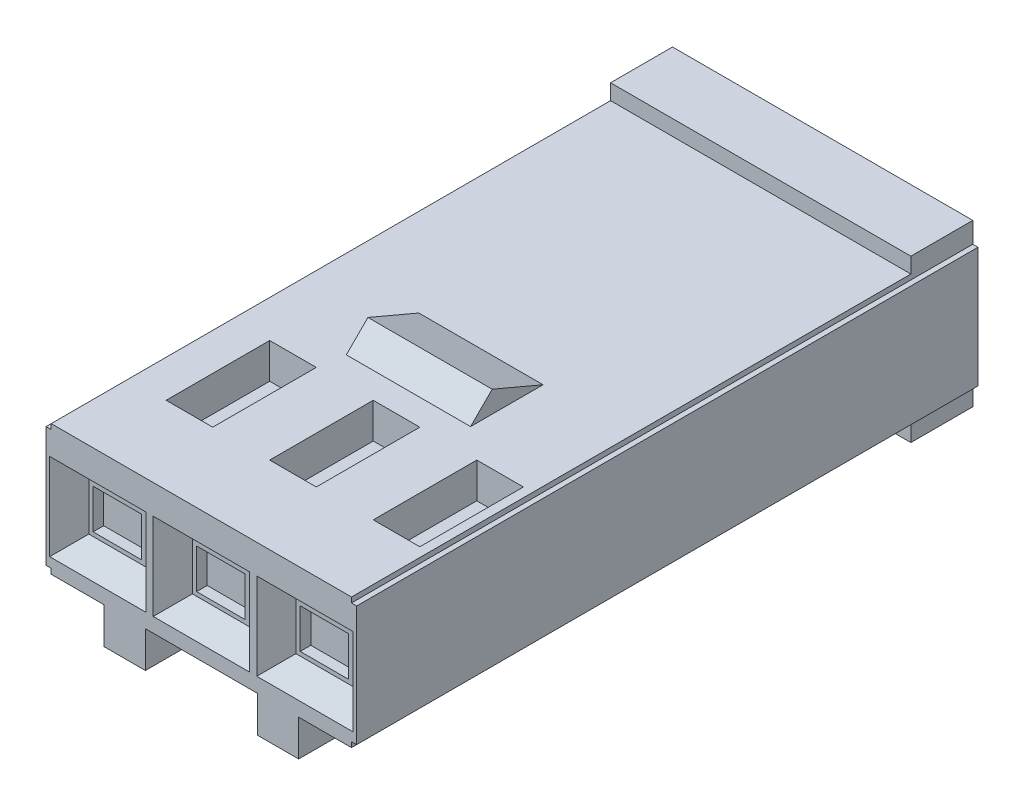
ISO-10303-21;
HEADER;
FILE_DESCRIPTION(('STEP AP214'),'2;1');
FILE_NAME('part.step','',(''),(''),'','','');
FILE_SCHEMA(('AUTOMOTIVE_DESIGN { 1 0 10303 214 1 1 1 1 }'));
ENDSEC;
DATA;
#1=APPLICATION_CONTEXT('core data for automotive mechanical design processes');
#2=APPLICATION_PROTOCOL_DEFINITION('international standard','automotive_design',2000,#1);
#3=PRODUCT_CONTEXT('',#1,'mechanical');
#4=PRODUCT('Part','Part','',(#3));
#5=PRODUCT_RELATED_PRODUCT_CATEGORY('part','',(#4));
#6=PRODUCT_DEFINITION_FORMATION('','',#4);
#7=PRODUCT_DEFINITION_CONTEXT('part definition',#1,'design');
#8=PRODUCT_DEFINITION('design','',#6,#7);
#9=PRODUCT_DEFINITION_SHAPE('','',#8);
#10=(LENGTH_UNIT() NAMED_UNIT(*) SI_UNIT(.MILLI.,.METRE.));
#11=(NAMED_UNIT(*) PLANE_ANGLE_UNIT() SI_UNIT($,.RADIAN.));
#12=(NAMED_UNIT(*) SI_UNIT($,.STERADIAN.) SOLID_ANGLE_UNIT());
#13=UNCERTAINTY_MEASURE_WITH_UNIT(LENGTH_MEASURE(1.E-05),#10,'distance_accuracy_value','');
#14=(GEOMETRIC_REPRESENTATION_CONTEXT(3) GLOBAL_UNCERTAINTY_ASSIGNED_CONTEXT((#13)) GLOBAL_UNIT_ASSIGNED_CONTEXT((#10,
#11,#12)) REPRESENTATION_CONTEXT('',''));
#15=CARTESIAN_POINT('',(0.,0.,0.));
#16=DIRECTION('',(0.,0.,1.));
#17=DIRECTION('',(1.,0.,0.));
#18=AXIS2_PLACEMENT_3D('',#15,#16,#17);
#19=CARTESIAN_POINT('',(-3.683,-1.4732,0.));
#20=DIRECTION('',(0.,1.,0.));
#21=DIRECTION('',(1.,0.,0.));
#22=AXIS2_PLACEMENT_3D('',#19,#20,#21);
#23=PLANE('',#22);
#24=DIRECTION('',(1.,0.,0.));
#25=VECTOR('',#24,1.);
#26=CARTESIAN_POINT('',(-3.81,-1.4732,-15.24));
#27=LINE('',#26,#25);
#28=CARTESIAN_POINT('',(-3.81,-1.4732,-15.24));
#29=VERTEX_POINT('',#28);
#30=CARTESIAN_POINT('',(-3.683,-1.4732,-15.24));
#31=VERTEX_POINT('',#30);
#32=EDGE_CURVE('E1101',#29,#31,#27,.T.);
#33=ORIENTED_EDGE('',*,*,#32,.T.);
#34=DIRECTION('',(0.,0.,-1.));
#35=VECTOR('',#34,1.);
#36=CARTESIAN_POINT('',(-3.683,-1.4732,0.));
#37=LINE('',#36,#35);
#38=CARTESIAN_POINT('',(-3.683,-1.4732,0.));
#39=VERTEX_POINT('',#38);
#40=EDGE_CURVE('E707',#39,#31,#37,.T.);
#41=ORIENTED_EDGE('',*,*,#40,.F.);
#42=DIRECTION('',(1.,0.,0.));
#43=VECTOR('',#42,1.);
#44=CARTESIAN_POINT('',(-3.81,-1.4732,0.));
#45=LINE('',#44,#43);
#46=CARTESIAN_POINT('',(-3.81,-1.4732,0.));
#47=VERTEX_POINT('',#46);
#48=EDGE_CURVE('E735',#47,#39,#45,.T.);
#49=ORIENTED_EDGE('',*,*,#48,.F.);
#50=DIRECTION('',(0.,0.,-1.));
#51=VECTOR('',#50,1.);
#52=CARTESIAN_POINT('',(-3.81,-1.4732,0.));
#53=LINE('',#52,#51);
#54=EDGE_CURVE('E1576',#47,#29,#53,.T.);
#55=ORIENTED_EDGE('',*,*,#54,.T.);
#56=EDGE_LOOP('',(#33,#41,#49,#55));
#57=FACE_BOUND('',#56,.T.);
#58=ADVANCED_FACE('F17',(#57),#23,.F.);
#59=CARTESIAN_POINT('',(1.3716,-1.6002,0.));
#60=DIRECTION('',(-1.,0.,0.));
#61=DIRECTION('',(0.,0.,1.));
#62=AXIS2_PLACEMENT_3D('',#59,#60,#61);
#63=PLANE('',#62);
#64=DIRECTION('',(0.,0.,1.));
#65=VECTOR('',#64,1.);
#66=CARTESIAN_POINT('',(1.3716,-1.9802,-15.24));
#67=LINE('',#66,#65);
#68=CARTESIAN_POINT('',(1.3716,-1.9802,-15.24));
#69=VERTEX_POINT('',#68);
#70=CARTESIAN_POINT('',(1.3716,-1.9802,-13.72));
#71=VERTEX_POINT('',#70);
#72=EDGE_CURVE('E716',#69,#71,#67,.T.);
#73=ORIENTED_EDGE('',*,*,#72,.F.);
#74=DIRECTION('',(0.,-1.,0.));
#75=VECTOR('',#74,1.);
#76=CARTESIAN_POINT('',(1.3716,-1.9802,-15.24));
#77=LINE('',#76,#75);
#78=CARTESIAN_POINT('',(1.3716,-2.4892,-15.24));
#79=VERTEX_POINT('',#78);
#80=EDGE_CURVE('E1142',#69,#79,#77,.T.);
#81=ORIENTED_EDGE('',*,*,#80,.T.);
#82=DIRECTION('',(0.,0.,-1.));
#83=VECTOR('',#82,1.);
#84=CARTESIAN_POINT('',(1.3716,-2.4892,0.));
#85=LINE('',#84,#83);
#86=CARTESIAN_POINT('',(1.3716,-2.4892,0.));
#87=VERTEX_POINT('',#86);
#88=EDGE_CURVE('E11',#87,#79,#85,.T.);
#89=ORIENTED_EDGE('',*,*,#88,.F.);
#90=DIRECTION('',(0.,-1.,0.));
#91=VECTOR('',#90,1.);
#92=CARTESIAN_POINT('',(1.3716,-1.6002,0.));
#93=LINE('',#92,#91);
#94=CARTESIAN_POINT('',(1.3716,-1.6002,0.));
#95=VERTEX_POINT('',#94);
#96=EDGE_CURVE('E750',#95,#87,#93,.T.);
#97=ORIENTED_EDGE('',*,*,#96,.F.);
#98=DIRECTION('',(0.,0.,-1.));
#99=VECTOR('',#98,1.);
#100=CARTESIAN_POINT('',(1.3716,-1.6002,0.));
#101=LINE('',#100,#99);
#102=CARTESIAN_POINT('',(1.3716,-1.6002,-13.72));
#103=VERTEX_POINT('',#102);
#104=EDGE_CURVE('E1502',#95,#103,#101,.T.);
#105=ORIENTED_EDGE('',*,*,#104,.T.);
#106=DIRECTION('',(0.,-1.,0.));
#107=VECTOR('',#106,1.);
#108=CARTESIAN_POINT('',(1.3716,-1.6002,-13.72));
#109=LINE('',#108,#107);
#110=EDGE_CURVE('E1444',#103,#71,#109,.T.);
#111=ORIENTED_EDGE('',*,*,#110,.T.);
#112=EDGE_LOOP('',(#73,#81,#89,#97,#105,#111));
#113=FACE_BOUND('',#112,.T.);
#114=ADVANCED_FACE('F1641',(#113),#63,.T.);
#115=CARTESIAN_POINT('',(-1.3716,-1.6002,-15.24));
#116=DIRECTION('',(1.,0.,0.));
#117=DIRECTION('',(0.,1.,0.));
#118=AXIS2_PLACEMENT_3D('',#115,#116,#117);
#119=PLANE('',#118);
#120=DIRECTION('',(0.,0.,-1.));
#121=VECTOR('',#120,1.);
#122=CARTESIAN_POINT('',(-1.3716,-1.6002,0.));
#123=LINE('',#122,#121);
#124=CARTESIAN_POINT('',(-1.3716,-1.6002,0.));
#125=VERTEX_POINT('',#124);
#126=CARTESIAN_POINT('',(-1.3716,-1.6002,-13.72));
#127=VERTEX_POINT('',#126);
#128=EDGE_CURVE('E703',#125,#127,#123,.T.);
#129=ORIENTED_EDGE('',*,*,#128,.F.);
#130=DIRECTION('',(0.,-1.,0.));
#131=VECTOR('',#130,1.);
#132=CARTESIAN_POINT('',(-1.3716,-1.6002,0.));
#133=LINE('',#132,#131);
#134=CARTESIAN_POINT('',(-1.3716,-2.4892,0.));
#135=VERTEX_POINT('',#134);
#136=EDGE_CURVE('E746',#125,#135,#133,.T.);
#137=ORIENTED_EDGE('',*,*,#136,.T.);
#138=DIRECTION('',(0.,0.,1.));
#139=VECTOR('',#138,1.);
#140=CARTESIAN_POINT('',(-1.3716,-2.4892,-15.24));
#141=LINE('',#140,#139);
#142=CARTESIAN_POINT('',(-1.3716,-2.4892,-15.24));
#143=VERTEX_POINT('',#142);
#144=EDGE_CURVE('E25',#143,#135,#141,.T.);
#145=ORIENTED_EDGE('',*,*,#144,.F.);
#146=DIRECTION('',(0.,-1.,0.));
#147=VECTOR('',#146,1.);
#148=CARTESIAN_POINT('',(-1.3716,-1.9802,-15.24));
#149=LINE('',#148,#147);
#150=CARTESIAN_POINT('',(-1.3716,-1.9802,-15.24));
#151=VERTEX_POINT('',#150);
#152=EDGE_CURVE('E1150',#151,#143,#149,.T.);
#153=ORIENTED_EDGE('',*,*,#152,.F.);
#154=DIRECTION('',(0.,0.,1.));
#155=VECTOR('',#154,1.);
#156=CARTESIAN_POINT('',(-1.3716,-1.9802,-15.24));
#157=LINE('',#156,#155);
#158=CARTESIAN_POINT('',(-1.3716,-1.9802,-13.72));
#159=VERTEX_POINT('',#158);
#160=EDGE_CURVE('E719',#151,#159,#157,.T.);
#161=ORIENTED_EDGE('',*,*,#160,.T.);
#162=DIRECTION('',(0.,-1.,0.));
#163=VECTOR('',#162,1.);
#164=CARTESIAN_POINT('',(-1.3716,-1.6002,-13.72));
#165=LINE('',#164,#163);
#166=EDGE_CURVE('E1131',#127,#159,#165,.T.);
#167=ORIENTED_EDGE('',*,*,#166,.F.);
#168=EDGE_LOOP('',(#129,#137,#145,#153,#161,#167));
#169=FACE_BOUND('',#168,.T.);
#170=ADVANCED_FACE('F1522',(#169),#119,.T.);
#171=CARTESIAN_POINT('',(-3.81,-2.4892,0.));
#172=DIRECTION('',(0.,-1.,0.));
#173=DIRECTION('',(0.,0.,-1.));
#174=AXIS2_PLACEMENT_3D('',#171,#172,#173);
#175=PLANE('',#174);
#176=ORIENTED_EDGE('',*,*,#88,.T.);
#177=DIRECTION('',(1.,0.,0.));
#178=VECTOR('',#177,1.);
#179=CARTESIAN_POINT('',(1.3716,-2.4892,-15.24));
#180=LINE('',#179,#178);
#181=CARTESIAN_POINT('',(2.3876,-2.4892,-15.24));
#182=VERTEX_POINT('',#181);
#183=EDGE_CURVE('E1052',#79,#182,#180,.T.);
#184=ORIENTED_EDGE('',*,*,#183,.T.);
#185=DIRECTION('',(0.,0.,1.));
#186=VECTOR('',#185,1.);
#187=CARTESIAN_POINT('',(2.3876,-2.4892,-15.24));
#188=LINE('',#187,#186);
#189=CARTESIAN_POINT('',(2.3876,-2.4892,0.));
#190=VERTEX_POINT('',#189);
#191=EDGE_CURVE('E1009',#182,#190,#188,.T.);
#192=ORIENTED_EDGE('',*,*,#191,.T.);
#193=DIRECTION('',(-1.,0.,0.));
#194=VECTOR('',#193,1.);
#195=CARTESIAN_POINT('',(2.3876,-2.4892,0.));
#196=LINE('',#195,#194);
#197=EDGE_CURVE('E681',#190,#87,#196,.T.);
#198=ORIENTED_EDGE('',*,*,#197,.T.);
#199=EDGE_LOOP('',(#176,#184,#192,#198));
#200=FACE_BOUND('',#199,.T.);
#201=ADVANCED_FACE('F1050',(#200),#175,.T.);
#202=CARTESIAN_POINT('',(-3.81,-2.4892,0.));
#203=DIRECTION('',(0.,-1.,0.));
#204=DIRECTION('',(0.,0.,-1.));
#205=AXIS2_PLACEMENT_3D('',#202,#203,#204);
#206=PLANE('',#205);
#207=DIRECTION('',(1.,0.,0.));
#208=VECTOR('',#207,1.);
#209=CARTESIAN_POINT('',(-2.3876,-2.4892,-15.24));
#210=LINE('',#209,#208);
#211=CARTESIAN_POINT('',(-2.3876,-2.4892,-15.24));
#212=VERTEX_POINT('',#211);
#213=EDGE_CURVE('E1154',#212,#143,#210,.T.);
#214=ORIENTED_EDGE('',*,*,#213,.T.);
#215=ORIENTED_EDGE('',*,*,#144,.T.);
#216=DIRECTION('',(-1.,0.,0.));
#217=VECTOR('',#216,1.);
#218=CARTESIAN_POINT('',(-1.3716,-2.4892,0.));
#219=LINE('',#218,#217);
#220=CARTESIAN_POINT('',(-2.3876,-2.4892,0.));
#221=VERTEX_POINT('',#220);
#222=EDGE_CURVE('E738',#135,#221,#219,.T.);
#223=ORIENTED_EDGE('',*,*,#222,.T.);
#224=DIRECTION('',(0.,0.,-1.));
#225=VECTOR('',#224,1.);
#226=CARTESIAN_POINT('',(-2.3876,-2.4892,0.));
#227=LINE('',#226,#225);
#228=EDGE_CURVE('E728',#221,#212,#227,.T.);
#229=ORIENTED_EDGE('',*,*,#228,.T.);
#230=EDGE_LOOP('',(#214,#215,#223,#229));
#231=FACE_BOUND('',#230,.T.);
#232=ADVANCED_FACE('F1716',(#231),#206,.T.);
#233=CARTESIAN_POINT('',(2.3876,-1.6002,-15.24));
#234=DIRECTION('',(1.,0.,0.));
#235=DIRECTION('',(0.,1.,0.));
#236=AXIS2_PLACEMENT_3D('',#233,#234,#235);
#237=PLANE('',#236);
#238=DIRECTION('',(0.,0.,-1.));
#239=VECTOR('',#238,1.);
#240=CARTESIAN_POINT('',(2.3876,-1.6002,0.));
#241=LINE('',#240,#239);
#242=CARTESIAN_POINT('',(2.3876,-1.6002,0.));
#243=VERTEX_POINT('',#242);
#244=CARTESIAN_POINT('',(2.3876,-1.6002,-13.72));
#245=VERTEX_POINT('',#244);
#246=EDGE_CURVE('E687',#243,#245,#241,.T.);
#247=ORIENTED_EDGE('',*,*,#246,.F.);
#248=DIRECTION('',(0.,-1.,0.));
#249=VECTOR('',#248,1.);
#250=CARTESIAN_POINT('',(2.3876,-1.6002,0.));
#251=LINE('',#250,#249);
#252=EDGE_CURVE('E671',#243,#190,#251,.T.);
#253=ORIENTED_EDGE('',*,*,#252,.T.);
#254=ORIENTED_EDGE('',*,*,#191,.F.);
#255=DIRECTION('',(0.,-1.,0.));
#256=VECTOR('',#255,1.);
#257=CARTESIAN_POINT('',(2.3876,-1.9802,-15.24));
#258=LINE('',#257,#256);
#259=CARTESIAN_POINT('',(2.3876,-1.9802,-15.24));
#260=VERTEX_POINT('',#259);
#261=EDGE_CURVE('E1055',#260,#182,#258,.T.);
#262=ORIENTED_EDGE('',*,*,#261,.F.);
#263=DIRECTION('',(0.,0.,1.));
#264=VECTOR('',#263,1.);
#265=CARTESIAN_POINT('',(2.3876,-1.9802,-15.24));
#266=LINE('',#265,#264);
#267=CARTESIAN_POINT('',(2.3876,-1.9802,-13.72));
#268=VERTEX_POINT('',#267);
#269=EDGE_CURVE('E725',#260,#268,#266,.T.);
#270=ORIENTED_EDGE('',*,*,#269,.T.);
#271=DIRECTION('',(0.,-1.,0.));
#272=VECTOR('',#271,1.);
#273=CARTESIAN_POINT('',(2.3876,-1.6002,-13.72));
#274=LINE('',#273,#272);
#275=EDGE_CURVE('E690',#245,#268,#274,.T.);
#276=ORIENTED_EDGE('',*,*,#275,.F.);
#277=EDGE_LOOP('',(#247,#253,#254,#262,#270,#276));
#278=FACE_BOUND('',#277,.T.);
#279=ADVANCED_FACE('F688',(#278),#237,.T.);
#280=CARTESIAN_POINT('',(3.683,-1.4732,0.));
#281=DIRECTION('',(-1.,0.,0.));
#282=DIRECTION('',(0.,0.,1.));
#283=AXIS2_PLACEMENT_3D('',#280,#281,#282);
#284=PLANE('',#283);
#285=DIRECTION('',(0.,0.,-1.));
#286=VECTOR('',#285,1.);
#287=CARTESIAN_POINT('',(3.683,-1.4732,0.));
#288=LINE('',#287,#286);
#289=CARTESIAN_POINT('',(3.683,-1.4732,0.));
#290=VERTEX_POINT('',#289);
#291=CARTESIAN_POINT('',(3.683,-1.4732,-15.24));
#292=VERTEX_POINT('',#291);
#293=EDGE_CURVE('E1044',#290,#292,#288,.T.);
#294=ORIENTED_EDGE('',*,*,#293,.F.);
#295=DIRECTION('',(0.,-1.,0.));
#296=VECTOR('',#295,1.);
#297=CARTESIAN_POINT('',(3.683,-1.4732,0.));
#298=LINE('',#297,#296);
#299=CARTESIAN_POINT('',(3.683,-1.6002,0.));
#300=VERTEX_POINT('',#299);
#301=EDGE_CURVE('E684',#290,#300,#298,.T.);
#302=ORIENTED_EDGE('',*,*,#301,.T.);
#303=DIRECTION('',(0.,0.,-1.));
#304=VECTOR('',#303,1.);
#305=CARTESIAN_POINT('',(3.683,-1.6002,0.));
#306=LINE('',#305,#304);
#307=CARTESIAN_POINT('',(3.683,-1.6002,-13.72));
#308=VERTEX_POINT('',#307);
#309=EDGE_CURVE('E698',#300,#308,#306,.T.);
#310=ORIENTED_EDGE('',*,*,#309,.T.);
#311=DIRECTION('',(0.,-1.,0.));
#312=VECTOR('',#311,1.);
#313=CARTESIAN_POINT('',(3.683,-1.6002,-13.72));
#314=LINE('',#313,#312);
#315=CARTESIAN_POINT('',(3.683,-1.9802,-13.72));
#316=VERTEX_POINT('',#315);
#317=EDGE_CURVE('E1457',#308,#316,#314,.T.);
#318=ORIENTED_EDGE('',*,*,#317,.T.);
#319=DIRECTION('',(0.,0.,1.));
#320=VECTOR('',#319,1.);
#321=CARTESIAN_POINT('',(3.683,-1.9802,-15.24));
#322=LINE('',#321,#320);
#323=CARTESIAN_POINT('',(3.683,-1.9802,-15.24));
#324=VERTEX_POINT('',#323);
#325=EDGE_CURVE('E722',#324,#316,#322,.T.);
#326=ORIENTED_EDGE('',*,*,#325,.F.);
#327=DIRECTION('',(0.,-1.,0.));
#328=VECTOR('',#327,1.);
#329=CARTESIAN_POINT('',(3.683,-1.4732,-15.24));
#330=LINE('',#329,#328);
#331=EDGE_CURVE('E1068',#292,#324,#330,.T.);
#332=ORIENTED_EDGE('',*,*,#331,.F.);
#333=EDGE_LOOP('',(#294,#302,#310,#318,#326,#332));
#334=FACE_BOUND('',#333,.T.);
#335=ADVANCED_FACE('F1689',(#334),#284,.F.);
#336=CARTESIAN_POINT('',(3.81,-1.4732,0.));
#337=DIRECTION('',(0.,1.,0.));
#338=DIRECTION('',(1.,0.,0.));
#339=AXIS2_PLACEMENT_3D('',#336,#337,#338);
#340=PLANE('',#339);
#341=DIRECTION('',(-1.,0.,0.));
#342=VECTOR('',#341,1.);
#343=CARTESIAN_POINT('',(3.81,-1.4732,0.));
#344=LINE('',#343,#342);
#345=CARTESIAN_POINT('',(3.81,-1.4732,0.));
#346=VERTEX_POINT('',#345);
#347=EDGE_CURVE('E757',#346,#290,#344,.T.);
#348=ORIENTED_EDGE('',*,*,#347,.T.);
#349=ORIENTED_EDGE('',*,*,#293,.T.);
#350=DIRECTION('',(-1.,0.,0.));
#351=VECTOR('',#350,1.);
#352=CARTESIAN_POINT('',(3.81,-1.4732,-15.24));
#353=LINE('',#352,#351);
#354=CARTESIAN_POINT('',(3.81,-1.4732,-15.24));
#355=VERTEX_POINT('',#354);
#356=EDGE_CURVE('E1076',#355,#292,#353,.T.);
#357=ORIENTED_EDGE('',*,*,#356,.F.);
#358=DIRECTION('',(0.,0.,-1.));
#359=VECTOR('',#358,1.);
#360=CARTESIAN_POINT('',(3.81,-1.4732,0.));
#361=LINE('',#360,#359);
#362=EDGE_CURVE('E1043',#346,#355,#361,.T.);
#363=ORIENTED_EDGE('',*,*,#362,.F.);
#364=EDGE_LOOP('',(#348,#349,#357,#363));
#365=FACE_BOUND('',#364,.T.);
#366=ADVANCED_FACE('F1686',(#365),#340,.F.);
#367=CARTESIAN_POINT('',(3.81,0.,0.));
#368=DIRECTION('',(1.,0.,0.));
#369=DIRECTION('',(0.,1.,0.));
#370=AXIS2_PLACEMENT_3D('',#367,#368,#369);
#371=PLANE('',#370);
#372=DIRECTION('',(0.,-1.,0.));
#373=VECTOR('',#372,1.);
#374=CARTESIAN_POINT('',(3.81,1.4732,0.));
#375=LINE('',#374,#373);
#376=CARTESIAN_POINT('',(3.81,1.4732,0.));
#377=VERTEX_POINT('',#376);
#378=EDGE_CURVE('E767',#377,#346,#375,.T.);
#379=ORIENTED_EDGE('',*,*,#378,.T.);
#380=ORIENTED_EDGE('',*,*,#362,.T.);
#381=DIRECTION('',(0.,1.,0.));
#382=VECTOR('',#381,1.);
#383=CARTESIAN_POINT('',(3.81,-1.4732,-15.24));
#384=LINE('',#383,#382);
#385=CARTESIAN_POINT('',(3.81,1.4732,-15.24));
#386=VERTEX_POINT('',#385);
#387=EDGE_CURVE('E1102',#355,#386,#384,.T.);
#388=ORIENTED_EDGE('',*,*,#387,.T.);
#389=DIRECTION('',(0.,0.,-1.));
#390=VECTOR('',#389,1.);
#391=CARTESIAN_POINT('',(3.81,1.4732,0.));
#392=LINE('',#391,#390);
#393=EDGE_CURVE('E1040',#377,#386,#392,.T.);
#394=ORIENTED_EDGE('',*,*,#393,.F.);
#395=EDGE_LOOP('',(#379,#380,#388,#394));
#396=FACE_BOUND('',#395,.T.);
#397=ADVANCED_FACE('F1683',(#396),#371,.T.);
#398=CARTESIAN_POINT('',(3.683,1.4732,0.));
#399=DIRECTION('',(0.,-1.,0.));
#400=DIRECTION('',(0.,0.,-1.));
#401=AXIS2_PLACEMENT_3D('',#398,#399,#400);
#402=PLANE('',#401);
#403=DIRECTION('',(-1.,0.,0.));
#404=VECTOR('',#403,1.);
#405=CARTESIAN_POINT('',(3.81,1.4732,-15.24));
#406=LINE('',#405,#404);
#407=CARTESIAN_POINT('',(3.683,1.4732,-15.24));
#408=VERTEX_POINT('',#407);
#409=EDGE_CURVE('E1106',#386,#408,#406,.T.);
#410=ORIENTED_EDGE('',*,*,#409,.T.);
#411=DIRECTION('',(0.,0.,-1.));
#412=VECTOR('',#411,1.);
#413=CARTESIAN_POINT('',(3.683,1.4732,0.));
#414=LINE('',#413,#412);
#415=CARTESIAN_POINT('',(3.683,1.4732,0.));
#416=VERTEX_POINT('',#415);
#417=EDGE_CURVE('E1107',#416,#408,#414,.T.);
#418=ORIENTED_EDGE('',*,*,#417,.F.);
#419=DIRECTION('',(-1.,0.,0.));
#420=VECTOR('',#419,1.);
#421=CARTESIAN_POINT('',(3.81,1.4732,0.));
#422=LINE('',#421,#420);
#423=EDGE_CURVE('E771',#377,#416,#422,.T.);
#424=ORIENTED_EDGE('',*,*,#423,.F.);
#425=ORIENTED_EDGE('',*,*,#393,.T.);
#426=EDGE_LOOP('',(#410,#418,#424,#425));
#427=FACE_BOUND('',#426,.T.);
#428=ADVANCED_FACE('F1679',(#427),#402,.F.);
#429=CARTESIAN_POINT('',(-3.683,1.9802,-15.24));
#430=DIRECTION('',(0.,1.,0.));
#431=DIRECTION('',(1.,0.,0.));
#432=AXIS2_PLACEMENT_3D('',#429,#430,#431);
#433=PLANE('',#432);
#434=DIRECTION('',(0.,0.,1.));
#435=VECTOR('',#434,1.);
#436=CARTESIAN_POINT('',(-3.683,1.9802,-15.24));
#437=LINE('',#436,#435);
#438=CARTESIAN_POINT('',(-3.683,1.9802,-15.24));
#439=VERTEX_POINT('',#438);
#440=CARTESIAN_POINT('',(-3.683,1.9802,-13.72));
#441=VERTEX_POINT('',#440);
#442=EDGE_CURVE('E1037',#439,#441,#437,.T.);
#443=ORIENTED_EDGE('',*,*,#442,.T.);
#444=DIRECTION('',(1.,0.,0.));
#445=VECTOR('',#444,1.);
#446=CARTESIAN_POINT('',(-3.683,1.9802,-13.72));
#447=LINE('',#446,#445);
#448=CARTESIAN_POINT('',(3.683,1.9802,-13.72));
#449=VERTEX_POINT('',#448);
#450=EDGE_CURVE('E1456',#441,#449,#447,.T.);
#451=ORIENTED_EDGE('',*,*,#450,.T.);
#452=DIRECTION('',(0.,0.,1.));
#453=VECTOR('',#452,1.);
#454=CARTESIAN_POINT('',(3.683,1.9802,-15.24));
#455=LINE('',#454,#453);
#456=CARTESIAN_POINT('',(3.683,1.9802,-15.24));
#457=VERTEX_POINT('',#456);
#458=EDGE_CURVE('E1110',#457,#449,#455,.T.);
#459=ORIENTED_EDGE('',*,*,#458,.F.);
#460=DIRECTION('',(1.,0.,0.));
#461=VECTOR('',#460,1.);
#462=CARTESIAN_POINT('',(-3.683,1.9802,-15.24));
#463=LINE('',#462,#461);
#464=EDGE_CURVE('E1100',#439,#457,#463,.T.);
#465=ORIENTED_EDGE('',*,*,#464,.F.);
#466=EDGE_LOOP('',(#443,#451,#459,#465));
#467=FACE_BOUND('',#466,.T.);
#468=ADVANCED_FACE('F1673',(#467),#433,.T.);
#469=CARTESIAN_POINT('',(-3.683,1.4732,0.));
#470=DIRECTION('',(1.,0.,0.));
#471=DIRECTION('',(0.,1.,0.));
#472=AXIS2_PLACEMENT_3D('',#469,#470,#471);
#473=PLANE('',#472);
#474=DIRECTION('',(0.,0.,-1.));
#475=VECTOR('',#474,1.);
#476=CARTESIAN_POINT('',(-3.683,1.4732,0.));
#477=LINE('',#476,#475);
#478=CARTESIAN_POINT('',(-3.683,1.4732,0.));
#479=VERTEX_POINT('',#478);
#480=CARTESIAN_POINT('',(-3.683,1.4732,-15.24));
#481=VERTEX_POINT('',#480);
#482=EDGE_CURVE('E1539',#479,#481,#477,.T.);
#483=ORIENTED_EDGE('',*,*,#482,.F.);
#484=DIRECTION('',(0.,-1.,0.));
#485=VECTOR('',#484,1.);
#486=CARTESIAN_POINT('',(-3.683,1.6002,0.));
#487=LINE('',#486,#485);
#488=CARTESIAN_POINT('',(-3.683,1.6002,0.));
#489=VERTEX_POINT('',#488);
#490=EDGE_CURVE('E774',#489,#479,#487,.T.);
#491=ORIENTED_EDGE('',*,*,#490,.F.);
#492=DIRECTION('',(0.,0.,1.));
#493=VECTOR('',#492,1.);
#494=CARTESIAN_POINT('',(-3.683,1.6002,-13.72));
#495=LINE('',#494,#493);
#496=CARTESIAN_POINT('',(-3.683,1.6002,-13.72));
#497=VERTEX_POINT('',#496);
#498=EDGE_CURVE('E1195',#497,#489,#495,.T.);
#499=ORIENTED_EDGE('',*,*,#498,.F.);
#500=DIRECTION('',(0.,1.,0.));
#501=VECTOR('',#500,1.);
#502=CARTESIAN_POINT('',(-3.683,1.6002,-13.72));
#503=LINE('',#502,#501);
#504=EDGE_CURVE('E1491',#497,#441,#503,.T.);
#505=ORIENTED_EDGE('',*,*,#504,.T.);
#506=ORIENTED_EDGE('',*,*,#442,.F.);
#507=DIRECTION('',(0.,1.,0.));
#508=VECTOR('',#507,1.);
#509=CARTESIAN_POINT('',(-3.683,1.4732,-15.24));
#510=LINE('',#509,#508);
#511=EDGE_CURVE('E1096',#481,#439,#510,.T.);
#512=ORIENTED_EDGE('',*,*,#511,.F.);
#513=EDGE_LOOP('',(#483,#491,#499,#505,#506,#512));
#514=FACE_BOUND('',#513,.T.);
#515=ADVANCED_FACE('F1667',(#514),#473,.F.);
#516=CARTESIAN_POINT('',(3.48,-0.18,-0.24));
#517=DIRECTION('',(-0.707106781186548,0.,0.707106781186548));
#518=DIRECTION('',(0.,1.,0.));
#519=AXIS2_PLACEMENT_3D('',#516,#517,#518);
#520=PLANE('',#519);
#521=DIRECTION('',(-0.577350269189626,0.577350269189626,-0.577350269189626));
#522=VECTOR('',#521,1.);
#523=CARTESIAN_POINT('',(3.72,-1.245,0.));
#524=LINE('',#523,#522);
#525=CARTESIAN_POINT('',(3.72,-1.245,0.));
#526=VERTEX_POINT('',#525);
#527=CARTESIAN_POINT('',(3.24,-0.765,-0.48));
#528=VERTEX_POINT('',#527);
#529=EDGE_CURVE('E742',#526,#528,#524,.T.);
#530=ORIENTED_EDGE('',*,*,#529,.F.);
#531=DIRECTION('',(0.,-1.,0.));
#532=VECTOR('',#531,1.);
#533=CARTESIAN_POINT('',(3.72,0.885,0.));
#534=LINE('',#533,#532);
#535=CARTESIAN_POINT('',(3.72,0.885,0.));
#536=VERTEX_POINT('',#535);
#537=EDGE_CURVE('E801',#536,#526,#534,.T.);
#538=ORIENTED_EDGE('',*,*,#537,.F.);
#539=DIRECTION('',(-0.577350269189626,-0.577350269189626,-0.577350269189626));
#540=VECTOR('',#539,1.);
#541=CARTESIAN_POINT('',(3.72,0.885,0.));
#542=LINE('',#541,#540);
#543=CARTESIAN_POINT('',(3.24,0.405,-0.48));
#544=VERTEX_POINT('',#543);
#545=EDGE_CURVE('E983',#536,#544,#542,.T.);
#546=ORIENTED_EDGE('',*,*,#545,.T.);
#547=DIRECTION('',(0.,-1.,0.));
#548=VECTOR('',#547,1.);
#549=CARTESIAN_POINT('',(3.24,0.405,-0.48));
#550=LINE('',#549,#548);
#551=EDGE_CURVE('E991',#544,#528,#550,.T.);
#552=ORIENTED_EDGE('',*,*,#551,.T.);
#553=EDGE_LOOP('',(#530,#538,#546,#552));
#554=FACE_BOUND('',#553,.T.);
#555=ADVANCED_FACE('F1624',(#554),#520,.T.);
#556=CARTESIAN_POINT('',(1.27,0.,-0.74));
#557=DIRECTION('',(0.,0.,1.));
#558=DIRECTION('',(1.,0.,0.));
#559=AXIS2_PLACEMENT_3D('',#556,#557,#558);
#560=PLANE('',#559);
#561=DIRECTION('',(1.,0.,0.));
#562=VECTOR('',#561,1.);
#563=CARTESIAN_POINT('',(1.945,-0.665,-0.74));
#564=LINE('',#563,#562);
#565=CARTESIAN_POINT('',(1.945,-0.665,-0.74));
#566=VERTEX_POINT('',#565);
#567=CARTESIAN_POINT('',(3.135,-0.665,-0.74));
#568=VERTEX_POINT('',#567);
#569=EDGE_CURVE('E37',#566,#568,#564,.T.);
#570=ORIENTED_EDGE('',*,*,#569,.T.);
#571=DIRECTION('',(0.,1.,0.));
#572=VECTOR('',#571,1.);
#573=CARTESIAN_POINT('',(3.135,-0.665,-0.74));
#574=LINE('',#573,#572);
#575=CARTESIAN_POINT('',(3.135,0.305,-0.74));
#576=VERTEX_POINT('',#575);
#577=EDGE_CURVE('E44',#568,#576,#574,.T.);
#578=ORIENTED_EDGE('',*,*,#577,.T.);
#579=DIRECTION('',(-1.,0.,0.));
#580=VECTOR('',#579,1.);
#581=CARTESIAN_POINT('',(3.135,0.305,-0.74));
#582=LINE('',#581,#580);
#583=CARTESIAN_POINT('',(1.945,0.305,-0.74));
#584=VERTEX_POINT('',#583);
#585=EDGE_CURVE('E1024',#576,#584,#582,.T.);
#586=ORIENTED_EDGE('',*,*,#585,.T.);
#587=DIRECTION('',(0.,-1.,0.));
#588=VECTOR('',#587,1.);
#589=CARTESIAN_POINT('',(1.945,0.305,-0.74));
#590=LINE('',#589,#588);
#591=EDGE_CURVE('E1017',#584,#566,#590,.T.);
#592=ORIENTED_EDGE('',*,*,#591,.T.);
#593=EDGE_LOOP('',(#570,#578,#586,#592));
#594=FACE_BOUND('',#593,.T.);
#595=ADVANCED_FACE('F2427',(#594),#560,.T.);
#596=CARTESIAN_POINT('',(1.945,-0.665,0.));
#597=DIRECTION('',(0.,-1.,0.));
#598=DIRECTION('',(0.,0.,-1.));
#599=AXIS2_PLACEMENT_3D('',#596,#597,#598);
#600=PLANE('',#599);
#601=DIRECTION('',(0.,0.,-1.));
#602=VECTOR('',#601,1.);
#603=CARTESIAN_POINT('',(3.135,-0.665,-0.48));
#604=LINE('',#603,#602);
#605=CARTESIAN_POINT('',(3.135,-0.665,-0.48));
#606=VERTEX_POINT('',#605);
#607=EDGE_CURVE('E1032',#606,#568,#604,.T.);
#608=ORIENTED_EDGE('',*,*,#607,.T.);
#609=ORIENTED_EDGE('',*,*,#569,.F.);
#610=DIRECTION('',(0.,0.,-1.));
#611=VECTOR('',#610,1.);
#612=CARTESIAN_POINT('',(1.945,-0.665,-0.48));
#613=LINE('',#612,#611);
#614=CARTESIAN_POINT('',(1.945,-0.665,-0.48));
#615=VERTEX_POINT('',#614);
#616=EDGE_CURVE('E1013',#615,#566,#613,.T.);
#617=ORIENTED_EDGE('',*,*,#616,.F.);
#618=DIRECTION('',(1.,0.,0.));
#619=VECTOR('',#618,1.);
#620=CARTESIAN_POINT('',(1.945,-0.665,-0.48));
#621=LINE('',#620,#619);
#622=EDGE_CURVE('E1002',#615,#606,#621,.T.);
#623=ORIENTED_EDGE('',*,*,#622,.T.);
#624=EDGE_LOOP('',(#608,#609,#617,#623));
#625=FACE_BOUND('',#624,.T.);
#626=ADVANCED_FACE('F2436',(#625),#600,.F.);
#627=CARTESIAN_POINT('',(3.135,-0.665,0.));
#628=DIRECTION('',(1.,0.,0.));
#629=DIRECTION('',(0.,1.,0.));
#630=AXIS2_PLACEMENT_3D('',#627,#628,#629);
#631=PLANE('',#630);
#632=DIRECTION('',(0.,0.,-1.));
#633=VECTOR('',#632,1.);
#634=CARTESIAN_POINT('',(3.135,0.305,-0.48));
#635=LINE('',#634,#633);
#636=CARTESIAN_POINT('',(3.135,0.305,-0.48));
#637=VERTEX_POINT('',#636);
#638=EDGE_CURVE('E1027',#637,#576,#635,.T.);
#639=ORIENTED_EDGE('',*,*,#638,.T.);
#640=ORIENTED_EDGE('',*,*,#577,.F.);
#641=ORIENTED_EDGE('',*,*,#607,.F.);
#642=DIRECTION('',(0.,1.,0.));
#643=VECTOR('',#642,1.);
#644=CARTESIAN_POINT('',(3.135,-0.665,-0.48));
#645=LINE('',#644,#643);
#646=EDGE_CURVE('E998',#606,#637,#645,.T.);
#647=ORIENTED_EDGE('',*,*,#646,.T.);
#648=EDGE_LOOP('',(#639,#640,#641,#647));
#649=FACE_BOUND('',#648,.T.);
#650=ADVANCED_FACE('F2445',(#649),#631,.F.);
#651=CARTESIAN_POINT('',(3.135,0.305,0.));
#652=DIRECTION('',(0.,1.,0.));
#653=DIRECTION('',(1.,0.,0.));
#654=AXIS2_PLACEMENT_3D('',#651,#652,#653);
#655=PLANE('',#654);
#656=DIRECTION('',(0.,0.,-1.));
#657=VECTOR('',#656,1.);
#658=CARTESIAN_POINT('',(1.945,0.305,-0.48));
#659=LINE('',#658,#657);
#660=CARTESIAN_POINT('',(1.945,0.305,-0.48));
#661=VERTEX_POINT('',#660);
#662=EDGE_CURVE('E1020',#661,#584,#659,.T.);
#663=ORIENTED_EDGE('',*,*,#662,.T.);
#664=ORIENTED_EDGE('',*,*,#585,.F.);
#665=ORIENTED_EDGE('',*,*,#638,.F.);
#666=DIRECTION('',(-1.,0.,0.));
#667=VECTOR('',#666,1.);
#668=CARTESIAN_POINT('',(3.135,0.305,-0.48));
#669=LINE('',#668,#667);
#670=EDGE_CURVE('E994',#637,#661,#669,.T.);
#671=ORIENTED_EDGE('',*,*,#670,.T.);
#672=EDGE_LOOP('',(#663,#664,#665,#671));
#673=FACE_BOUND('',#672,.T.);
#674=ADVANCED_FACE('F2455',(#673),#655,.F.);
#675=CARTESIAN_POINT('',(1.945,0.305,0.));
#676=DIRECTION('',(-1.,0.,0.));
#677=DIRECTION('',(0.,0.,1.));
#678=AXIS2_PLACEMENT_3D('',#675,#676,#677);
#679=PLANE('',#678);
#680=ORIENTED_EDGE('',*,*,#616,.T.);
#681=ORIENTED_EDGE('',*,*,#591,.F.);
#682=ORIENTED_EDGE('',*,*,#662,.F.);
#683=DIRECTION('',(0.,-1.,0.));
#684=VECTOR('',#683,1.);
#685=CARTESIAN_POINT('',(1.945,0.305,-0.48));
#686=LINE('',#685,#684);
#687=EDGE_CURVE('E1006',#661,#615,#686,.T.);
#688=ORIENTED_EDGE('',*,*,#687,.T.);
#689=EDGE_LOOP('',(#680,#681,#682,#688));
#690=FACE_BOUND('',#689,.T.);
#691=ADVANCED_FACE('F1635',(#690),#679,.F.);
#692=CARTESIAN_POINT('',(1.27,0.,-0.48));
#693=DIRECTION('',(0.,0.,1.));
#694=DIRECTION('',(1.,0.,0.));
#695=AXIS2_PLACEMENT_3D('',#692,#693,#694);
#696=PLANE('',#695);
#697=ORIENTED_EDGE('',*,*,#670,.F.);
#698=ORIENTED_EDGE('',*,*,#646,.F.);
#699=ORIENTED_EDGE('',*,*,#622,.F.);
#700=ORIENTED_EDGE('',*,*,#687,.F.);
#701=EDGE_LOOP('',(#697,#698,#699,#700));
#702=FACE_BOUND('',#701,.T.);
#703=ORIENTED_EDGE('',*,*,#551,.F.);
#704=DIRECTION('',(1.,0.,0.));
#705=VECTOR('',#704,1.);
#706=CARTESIAN_POINT('',(1.84,0.405,-0.48));
#707=LINE('',#706,#705);
#708=CARTESIAN_POINT('',(1.84,0.405,-0.48));
#709=VERTEX_POINT('',#708);
#710=EDGE_CURVE('E987',#709,#544,#707,.T.);
#711=ORIENTED_EDGE('',*,*,#710,.F.);
#712=DIRECTION('',(0.,1.,0.));
#713=VECTOR('',#712,1.);
#714=CARTESIAN_POINT('',(1.84,-0.765,-0.48));
#715=LINE('',#714,#713);
#716=CARTESIAN_POINT('',(1.84,-0.765,-0.48));
#717=VERTEX_POINT('',#716);
#718=EDGE_CURVE('E930',#717,#709,#715,.T.);
#719=ORIENTED_EDGE('',*,*,#718,.F.);
#720=DIRECTION('',(-1.,0.,0.));
#721=VECTOR('',#720,1.);
#722=CARTESIAN_POINT('',(3.24,-0.765,-0.48));
#723=LINE('',#722,#721);
#724=EDGE_CURVE('E976',#528,#717,#723,.T.);
#725=ORIENTED_EDGE('',*,*,#724,.F.);
#726=EDGE_LOOP('',(#703,#711,#719,#725));
#727=FACE_BOUND('',#726,.T.);
#728=ADVANCED_FACE('F1615',(#702,#727),#696,.T.);
#729=CARTESIAN_POINT('',(2.54,0.645,-0.24));
#730=DIRECTION('',(0.,-0.707106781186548,0.707106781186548));
#731=DIRECTION('',(-1.,0.,0.));
#732=AXIS2_PLACEMENT_3D('',#729,#730,#731);
#733=PLANE('',#732);
#734=ORIENTED_EDGE('',*,*,#545,.F.);
#735=DIRECTION('',(1.,0.,0.));
#736=VECTOR('',#735,1.);
#737=CARTESIAN_POINT('',(1.36,0.885,0.));
#738=LINE('',#737,#736);
#739=CARTESIAN_POINT('',(1.36,0.885,0.));
#740=VERTEX_POINT('',#739);
#741=EDGE_CURVE('E797',#740,#536,#738,.T.);
#742=ORIENTED_EDGE('',*,*,#741,.F.);
#743=DIRECTION('',(0.577350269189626,-0.577350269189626,-0.577350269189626));
#744=VECTOR('',#743,1.);
#745=CARTESIAN_POINT('',(1.36,0.885,0.));
#746=LINE('',#745,#744);
#747=EDGE_CURVE('E934',#740,#709,#746,.T.);
#748=ORIENTED_EDGE('',*,*,#747,.T.);
#749=ORIENTED_EDGE('',*,*,#710,.T.);
#750=EDGE_LOOP('',(#734,#742,#748,#749));
#751=FACE_BOUND('',#750,.T.);
#752=ADVANCED_FACE('F1626',(#751),#733,.T.);
#753=CARTESIAN_POINT('',(1.6,-0.18,-0.24));
#754=DIRECTION('',(0.707106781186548,0.,0.707106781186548));
#755=DIRECTION('',(0.,-1.,0.));
#756=AXIS2_PLACEMENT_3D('',#753,#754,#755);
#757=PLANE('',#756);
#758=DIRECTION('',(0.577350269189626,0.577350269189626,-0.577350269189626));
#759=VECTOR('',#758,1.);
#760=CARTESIAN_POINT('',(1.36,-1.245,0.));
#761=LINE('',#760,#759);
#762=CARTESIAN_POINT('',(1.36,-1.245,0.));
#763=VERTEX_POINT('',#762);
#764=EDGE_CURVE('E935',#763,#717,#761,.T.);
#765=ORIENTED_EDGE('',*,*,#764,.T.);
#766=ORIENTED_EDGE('',*,*,#718,.T.);
#767=ORIENTED_EDGE('',*,*,#747,.F.);
#768=DIRECTION('',(0.,1.,0.));
#769=VECTOR('',#768,1.);
#770=CARTESIAN_POINT('',(1.36,-1.245,0.));
#771=LINE('',#770,#769);
#772=EDGE_CURVE('E793',#763,#740,#771,.T.);
#773=ORIENTED_EDGE('',*,*,#772,.F.);
#774=EDGE_LOOP('',(#765,#766,#767,#773));
#775=FACE_BOUND('',#774,.T.);
#776=ADVANCED_FACE('F1618',(#775),#757,.T.);
#777=CARTESIAN_POINT('',(2.54,-1.005,-0.24));
#778=DIRECTION('',(0.,0.707106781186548,0.707106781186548));
#779=DIRECTION('',(1.,0.,0.));
#780=AXIS2_PLACEMENT_3D('',#777,#778,#779);
#781=PLANE('',#780);
#782=ORIENTED_EDGE('',*,*,#529,.T.);
#783=ORIENTED_EDGE('',*,*,#724,.T.);
#784=ORIENTED_EDGE('',*,*,#764,.F.);
#785=DIRECTION('',(-1.,0.,0.));
#786=VECTOR('',#785,1.);
#787=CARTESIAN_POINT('',(3.72,-1.245,0.));
#788=LINE('',#787,#786);
#789=EDGE_CURVE('E805',#526,#763,#788,.T.);
#790=ORIENTED_EDGE('',*,*,#789,.F.);
#791=EDGE_LOOP('',(#782,#783,#784,#790));
#792=FACE_BOUND('',#791,.T.);
#793=ADVANCED_FACE('F1612',(#792),#781,.T.);
#794=CARTESIAN_POINT('',(0.94,-0.18,-0.24));
#795=DIRECTION('',(-0.707106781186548,0.,0.707106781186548));
#796=DIRECTION('',(0.,1.,0.));
#797=AXIS2_PLACEMENT_3D('',#794,#795,#796);
#798=PLANE('',#797);
#799=DIRECTION('',(-0.577350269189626,0.577350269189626,-0.577350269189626));
#800=VECTOR('',#799,1.);
#801=CARTESIAN_POINT('',(1.18,-1.245,0.));
#802=LINE('',#801,#800);
#803=CARTESIAN_POINT('',(1.18,-1.245,0.));
#804=VERTEX_POINT('',#803);
#805=CARTESIAN_POINT('',(0.7,-0.765,-0.48));
#806=VERTEX_POINT('',#805);
#807=EDGE_CURVE('E901',#804,#806,#802,.T.);
#808=ORIENTED_EDGE('',*,*,#807,.F.);
#809=DIRECTION('',(0.,-1.,0.));
#810=VECTOR('',#809,1.);
#811=CARTESIAN_POINT('',(1.18,0.885,0.));
#812=LINE('',#811,#810);
#813=CARTESIAN_POINT('',(1.18,0.885,0.));
#814=VERTEX_POINT('',#813);
#815=EDGE_CURVE('E785',#814,#804,#812,.T.);
#816=ORIENTED_EDGE('',*,*,#815,.F.);
#817=DIRECTION('',(-0.577350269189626,-0.577350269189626,-0.577350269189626));
#818=VECTOR('',#817,1.);
#819=CARTESIAN_POINT('',(1.18,0.885,0.));
#820=LINE('',#819,#818);
#821=CARTESIAN_POINT('',(0.7,0.405,-0.48));
#822=VERTEX_POINT('',#821);
#823=EDGE_CURVE('E921',#814,#822,#820,.T.);
#824=ORIENTED_EDGE('',*,*,#823,.T.);
#825=DIRECTION('',(0.,-1.,0.));
#826=VECTOR('',#825,1.);
#827=CARTESIAN_POINT('',(0.7,0.405,-0.48));
#828=LINE('',#827,#826);
#829=EDGE_CURVE('E929',#822,#806,#828,.T.);
#830=ORIENTED_EDGE('',*,*,#829,.T.);
#831=EDGE_LOOP('',(#808,#816,#824,#830));
#832=FACE_BOUND('',#831,.T.);
#833=ADVANCED_FACE('F1770',(#832),#798,.T.);
#834=CARTESIAN_POINT('',(-1.27,0.,-0.74));
#835=DIRECTION('',(0.,0.,1.));
#836=DIRECTION('',(1.,0.,0.));
#837=AXIS2_PLACEMENT_3D('',#834,#835,#836);
#838=PLANE('',#837);
#839=DIRECTION('',(1.,0.,0.));
#840=VECTOR('',#839,1.);
#841=CARTESIAN_POINT('',(-0.595,-0.665,-0.74));
#842=LINE('',#841,#840);
#843=CARTESIAN_POINT('',(-0.595,-0.665,-0.74));
#844=VERTEX_POINT('',#843);
#845=CARTESIAN_POINT('',(0.595,-0.665,-0.74));
#846=VERTEX_POINT('',#845);
#847=EDGE_CURVE('E739',#844,#846,#842,.T.);
#848=ORIENTED_EDGE('',*,*,#847,.T.);
#849=DIRECTION('',(0.,1.,0.));
#850=VECTOR('',#849,1.);
#851=CARTESIAN_POINT('',(0.595,-0.665,-0.74));
#852=LINE('',#851,#850);
#853=CARTESIAN_POINT('',(0.595,0.305,-0.74));
#854=VERTEX_POINT('',#853);
#855=EDGE_CURVE('E818',#846,#854,#852,.T.);
#856=ORIENTED_EDGE('',*,*,#855,.T.);
#857=DIRECTION('',(-1.,0.,0.));
#858=VECTOR('',#857,1.);
#859=CARTESIAN_POINT('',(0.595,0.305,-0.74));
#860=LINE('',#859,#858);
#861=CARTESIAN_POINT('',(-0.595,0.305,-0.74));
#862=VERTEX_POINT('',#861);
#863=EDGE_CURVE('E819',#854,#862,#860,.T.);
#864=ORIENTED_EDGE('',*,*,#863,.T.);
#865=DIRECTION('',(0.,-1.,0.));
#866=VECTOR('',#865,1.);
#867=CARTESIAN_POINT('',(-0.595,0.305,-0.74));
#868=LINE('',#867,#866);
#869=EDGE_CURVE('E958',#862,#844,#868,.T.);
#870=ORIENTED_EDGE('',*,*,#869,.T.);
#871=EDGE_LOOP('',(#848,#856,#864,#870));
#872=FACE_BOUND('',#871,.T.);
#873=ADVANCED_FACE('F1766',(#872),#838,.T.);
#874=CARTESIAN_POINT('',(-0.595,-0.665,0.));
#875=DIRECTION('',(0.,-1.,0.));
#876=DIRECTION('',(0.,0.,-1.));
#877=AXIS2_PLACEMENT_3D('',#874,#875,#876);
#878=PLANE('',#877);
#879=DIRECTION('',(0.,0.,-1.));
#880=VECTOR('',#879,1.);
#881=CARTESIAN_POINT('',(0.595,-0.665,-0.48));
#882=LINE('',#881,#880);
#883=CARTESIAN_POINT('',(0.595,-0.665,-0.48));
#884=VERTEX_POINT('',#883);
#885=EDGE_CURVE('E743',#884,#846,#882,.T.);
#886=ORIENTED_EDGE('',*,*,#885,.T.);
#887=ORIENTED_EDGE('',*,*,#847,.F.);
#888=DIRECTION('',(0.,0.,-1.));
#889=VECTOR('',#888,1.);
#890=CARTESIAN_POINT('',(-0.595,-0.665,-0.48));
#891=LINE('',#890,#889);
#892=CARTESIAN_POINT('',(-0.595,-0.665,-0.48));
#893=VERTEX_POINT('',#892);
#894=EDGE_CURVE('E954',#893,#844,#891,.T.);
#895=ORIENTED_EDGE('',*,*,#894,.F.);
#896=DIRECTION('',(1.,0.,0.));
#897=VECTOR('',#896,1.);
#898=CARTESIAN_POINT('',(-0.595,-0.665,-0.48));
#899=LINE('',#898,#897);
#900=EDGE_CURVE('E946',#893,#884,#899,.T.);
#901=ORIENTED_EDGE('',*,*,#900,.T.);
#902=EDGE_LOOP('',(#886,#887,#895,#901));
#903=FACE_BOUND('',#902,.T.);
#904=ADVANCED_FACE('F1769',(#903),#878,.F.);
#905=CARTESIAN_POINT('',(0.595,-0.665,0.));
#906=DIRECTION('',(1.,0.,0.));
#907=DIRECTION('',(0.,1.,0.));
#908=AXIS2_PLACEMENT_3D('',#905,#906,#907);
#909=PLANE('',#908);
#910=DIRECTION('',(0.,0.,-1.));
#911=VECTOR('',#910,1.);
#912=CARTESIAN_POINT('',(0.595,0.305,-0.48));
#913=LINE('',#912,#911);
#914=CARTESIAN_POINT('',(0.595,0.305,-0.48));
#915=VERTEX_POINT('',#914);
#916=EDGE_CURVE('E814',#915,#854,#913,.T.);
#917=ORIENTED_EDGE('',*,*,#916,.T.);
#918=ORIENTED_EDGE('',*,*,#855,.F.);
#919=ORIENTED_EDGE('',*,*,#885,.F.);
#920=DIRECTION('',(0.,1.,0.));
#921=VECTOR('',#920,1.);
#922=CARTESIAN_POINT('',(0.595,-0.665,-0.48));
#923=LINE('',#922,#921);
#924=EDGE_CURVE('E942',#884,#915,#923,.T.);
#925=ORIENTED_EDGE('',*,*,#924,.T.);
#926=EDGE_LOOP('',(#917,#918,#919,#925));
#927=FACE_BOUND('',#926,.T.);
#928=ADVANCED_FACE('F1795',(#927),#909,.F.);
#929=CARTESIAN_POINT('',(0.595,0.305,0.));
#930=DIRECTION('',(0.,1.,0.));
#931=DIRECTION('',(1.,0.,0.));
#932=AXIS2_PLACEMENT_3D('',#929,#930,#931);
#933=PLANE('',#932);
#934=DIRECTION('',(0.,0.,-1.));
#935=VECTOR('',#934,1.);
#936=CARTESIAN_POINT('',(-0.595,0.305,-0.48));
#937=LINE('',#936,#935);
#938=CARTESIAN_POINT('',(-0.595,0.305,-0.48));
#939=VERTEX_POINT('',#938);
#940=EDGE_CURVE('E962',#939,#862,#937,.T.);
#941=ORIENTED_EDGE('',*,*,#940,.T.);
#942=ORIENTED_EDGE('',*,*,#863,.F.);
#943=ORIENTED_EDGE('',*,*,#916,.F.);
#944=DIRECTION('',(-1.,0.,0.));
#945=VECTOR('',#944,1.);
#946=CARTESIAN_POINT('',(0.595,0.305,-0.48));
#947=LINE('',#946,#945);
#948=EDGE_CURVE('E938',#915,#939,#947,.T.);
#949=ORIENTED_EDGE('',*,*,#948,.T.);
#950=EDGE_LOOP('',(#941,#942,#943,#949));
#951=FACE_BOUND('',#950,.T.);
#952=ADVANCED_FACE('F1791',(#951),#933,.F.);
#953=CARTESIAN_POINT('',(-0.595,0.305,0.));
#954=DIRECTION('',(-1.,0.,0.));
#955=DIRECTION('',(0.,0.,1.));
#956=AXIS2_PLACEMENT_3D('',#953,#954,#955);
#957=PLANE('',#956);
#958=ORIENTED_EDGE('',*,*,#894,.T.);
#959=ORIENTED_EDGE('',*,*,#869,.F.);
#960=ORIENTED_EDGE('',*,*,#940,.F.);
#961=DIRECTION('',(0.,-1.,0.));
#962=VECTOR('',#961,1.);
#963=CARTESIAN_POINT('',(-0.595,0.305,-0.48));
#964=LINE('',#963,#962);
#965=EDGE_CURVE('E950',#939,#893,#964,.T.);
#966=ORIENTED_EDGE('',*,*,#965,.T.);
#967=EDGE_LOOP('',(#958,#959,#960,#966));
#968=FACE_BOUND('',#967,.T.);
#969=ADVANCED_FACE('F1785',(#968),#957,.F.);
#970=CARTESIAN_POINT('',(-1.27,0.,-0.48));
#971=DIRECTION('',(0.,0.,1.));
#972=DIRECTION('',(1.,0.,0.));
#973=AXIS2_PLACEMENT_3D('',#970,#971,#972);
#974=PLANE('',#973);
#975=ORIENTED_EDGE('',*,*,#948,.F.);
#976=ORIENTED_EDGE('',*,*,#924,.F.);
#977=ORIENTED_EDGE('',*,*,#900,.F.);
#978=ORIENTED_EDGE('',*,*,#965,.F.);
#979=EDGE_LOOP('',(#975,#976,#977,#978));
#980=FACE_BOUND('',#979,.T.);
#981=ORIENTED_EDGE('',*,*,#829,.F.);
#982=DIRECTION('',(1.,0.,0.));
#983=VECTOR('',#982,1.);
#984=CARTESIAN_POINT('',(-0.7,0.405,-0.48));
#985=LINE('',#984,#983);
#986=CARTESIAN_POINT('',(-0.7,0.405,-0.48));
#987=VERTEX_POINT('',#986);
#988=EDGE_CURVE('E925',#987,#822,#985,.T.);
#989=ORIENTED_EDGE('',*,*,#988,.F.);
#990=DIRECTION('',(0.,1.,0.));
#991=VECTOR('',#990,1.);
#992=CARTESIAN_POINT('',(-0.7,-0.765,-0.48));
#993=LINE('',#992,#991);
#994=CARTESIAN_POINT('',(-0.7,-0.765,-0.48));
#995=VERTEX_POINT('',#994);
#996=EDGE_CURVE('E913',#995,#987,#993,.T.);
#997=ORIENTED_EDGE('',*,*,#996,.F.);
#998=DIRECTION('',(-1.,0.,0.));
#999=VECTOR('',#998,1.);
#1000=CARTESIAN_POINT('',(0.7,-0.765,-0.48));
#1001=LINE('',#1000,#999);
#1002=EDGE_CURVE('E905',#806,#995,#1001,.T.);
#1003=ORIENTED_EDGE('',*,*,#1002,.F.);
#1004=EDGE_LOOP('',(#981,#989,#997,#1003));
#1005=FACE_BOUND('',#1004,.T.);
#1006=ADVANCED_FACE('F1781',(#980,#1005),#974,.T.);
#1007=CARTESIAN_POINT('',(0.,0.645,-0.24));
#1008=DIRECTION('',(0.,-0.707106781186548,0.707106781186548));
#1009=DIRECTION('',(-1.,0.,0.));
#1010=AXIS2_PLACEMENT_3D('',#1007,#1008,#1009);
#1011=PLANE('',#1010);
#1012=ORIENTED_EDGE('',*,*,#823,.F.);
#1013=DIRECTION('',(1.,0.,0.));
#1014=VECTOR('',#1013,1.);
#1015=CARTESIAN_POINT('',(-1.18,0.885,0.));
#1016=LINE('',#1015,#1014);
#1017=CARTESIAN_POINT('',(-1.18,0.885,0.));
#1018=VERTEX_POINT('',#1017);
#1019=EDGE_CURVE('E781',#1018,#814,#1016,.T.);
#1020=ORIENTED_EDGE('',*,*,#1019,.F.);
#1021=DIRECTION('',(0.577350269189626,-0.577350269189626,-0.577350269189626));
#1022=VECTOR('',#1021,1.);
#1023=CARTESIAN_POINT('',(-1.18,0.885,0.));
#1024=LINE('',#1023,#1022);
#1025=EDGE_CURVE('E917',#1018,#987,#1024,.T.);
#1026=ORIENTED_EDGE('',*,*,#1025,.T.);
#1027=ORIENTED_EDGE('',*,*,#988,.T.);
#1028=EDGE_LOOP('',(#1012,#1020,#1026,#1027));
#1029=FACE_BOUND('',#1028,.T.);
#1030=ADVANCED_FACE('F1760',(#1029),#1011,.T.);
#1031=CARTESIAN_POINT('',(-0.94,-0.18,-0.24));
#1032=DIRECTION('',(0.707106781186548,0.,0.707106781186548));
#1033=DIRECTION('',(0.,-1.,0.));
#1034=AXIS2_PLACEMENT_3D('',#1031,#1032,#1033);
#1035=PLANE('',#1034);
#1036=DIRECTION('',(0.577350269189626,0.577350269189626,-0.577350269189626));
#1037=VECTOR('',#1036,1.);
#1038=CARTESIAN_POINT('',(-1.18,-1.245,0.));
#1039=LINE('',#1038,#1037);
#1040=CARTESIAN_POINT('',(-1.18,-1.245,0.));
#1041=VERTEX_POINT('',#1040);
#1042=EDGE_CURVE('E909',#1041,#995,#1039,.T.);
#1043=ORIENTED_EDGE('',*,*,#1042,.T.);
#1044=ORIENTED_EDGE('',*,*,#996,.T.);
#1045=ORIENTED_EDGE('',*,*,#1025,.F.);
#1046=DIRECTION('',(0.,1.,0.));
#1047=VECTOR('',#1046,1.);
#1048=CARTESIAN_POINT('',(-1.18,-1.245,0.));
#1049=LINE('',#1048,#1047);
#1050=EDGE_CURVE('E777',#1041,#1018,#1049,.T.);
#1051=ORIENTED_EDGE('',*,*,#1050,.F.);
#1052=EDGE_LOOP('',(#1043,#1044,#1045,#1051));
#1053=FACE_BOUND('',#1052,.T.);
#1054=ADVANCED_FACE('F1756',(#1053),#1035,.T.);
#1055=CARTESIAN_POINT('',(0.,-1.005,-0.24));
#1056=DIRECTION('',(0.,0.707106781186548,0.707106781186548));
#1057=DIRECTION('',(1.,0.,0.));
#1058=AXIS2_PLACEMENT_3D('',#1055,#1056,#1057);
#1059=PLANE('',#1058);
#1060=ORIENTED_EDGE('',*,*,#807,.T.);
#1061=ORIENTED_EDGE('',*,*,#1002,.T.);
#1062=ORIENTED_EDGE('',*,*,#1042,.F.);
#1063=DIRECTION('',(-1.,0.,0.));
#1064=VECTOR('',#1063,1.);
#1065=CARTESIAN_POINT('',(1.18,-1.245,0.));
#1066=LINE('',#1065,#1064);
#1067=EDGE_CURVE('E789',#804,#1041,#1066,.T.);
#1068=ORIENTED_EDGE('',*,*,#1067,.F.);
#1069=EDGE_LOOP('',(#1060,#1061,#1062,#1068));
#1070=FACE_BOUND('',#1069,.T.);
#1071=ADVANCED_FACE('F1759',(#1070),#1059,.T.);
#1072=CARTESIAN_POINT('',(-1.6,-0.18,-0.24));
#1073=DIRECTION('',(-0.707106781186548,0.,0.707106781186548));
#1074=DIRECTION('',(0.,1.,0.));
#1075=AXIS2_PLACEMENT_3D('',#1072,#1073,#1074);
#1076=PLANE('',#1075);
#1077=DIRECTION('',(-0.577350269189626,0.577350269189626,-0.577350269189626));
#1078=VECTOR('',#1077,1.);
#1079=CARTESIAN_POINT('',(-1.36,-1.245,0.));
#1080=LINE('',#1079,#1078);
#1081=CARTESIAN_POINT('',(-1.36,-1.245,0.));
#1082=VERTEX_POINT('',#1081);
#1083=CARTESIAN_POINT('',(-1.84,-0.765,-0.48));
#1084=VERTEX_POINT('',#1083);
#1085=EDGE_CURVE('E758',#1082,#1084,#1080,.T.);
#1086=ORIENTED_EDGE('',*,*,#1085,.F.);
#1087=DIRECTION('',(0.,-1.,0.));
#1088=VECTOR('',#1087,1.);
#1089=CARTESIAN_POINT('',(-1.36,0.885,0.));
#1090=LINE('',#1089,#1088);
#1091=CARTESIAN_POINT('',(-1.36,0.885,0.));
#1092=VERTEX_POINT('',#1091);
#1093=EDGE_CURVE('E823',#1092,#1082,#1090,.T.);
#1094=ORIENTED_EDGE('',*,*,#1093,.F.);
#1095=DIRECTION('',(-0.577350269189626,-0.577350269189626,-0.577350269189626));
#1096=VECTOR('',#1095,1.);
#1097=CARTESIAN_POINT('',(-1.36,0.885,0.));
#1098=LINE('',#1097,#1096);
#1099=CARTESIAN_POINT('',(-1.84,0.405,-0.48));
#1100=VERTEX_POINT('',#1099);
#1101=EDGE_CURVE('E853',#1092,#1100,#1098,.T.);
#1102=ORIENTED_EDGE('',*,*,#1101,.T.);
#1103=DIRECTION('',(0.,-1.,0.));
#1104=VECTOR('',#1103,1.);
#1105=CARTESIAN_POINT('',(-1.84,0.405,-0.48));
#1106=LINE('',#1105,#1104);
#1107=EDGE_CURVE('E852',#1100,#1084,#1106,.T.);
#1108=ORIENTED_EDGE('',*,*,#1107,.T.);
#1109=EDGE_LOOP('',(#1086,#1094,#1102,#1108));
#1110=FACE_BOUND('',#1109,.T.);
#1111=ADVANCED_FACE('F1772',(#1110),#1076,.T.);
#1112=CARTESIAN_POINT('',(-3.81,0.,-0.74));
#1113=DIRECTION('',(0.,0.,1.));
#1114=DIRECTION('',(1.,0.,0.));
#1115=AXIS2_PLACEMENT_3D('',#1112,#1113,#1114);
#1116=PLANE('',#1115);
#1117=DIRECTION('',(1.,0.,0.));
#1118=VECTOR('',#1117,1.);
#1119=CARTESIAN_POINT('',(-3.135,-0.665,-0.74));
#1120=LINE('',#1119,#1118);
#1121=CARTESIAN_POINT('',(-3.135,-0.665,-0.74));
#1122=VERTEX_POINT('',#1121);
#1123=CARTESIAN_POINT('',(-1.945,-0.665,-0.74));
#1124=VERTEX_POINT('',#1123);
#1125=EDGE_CURVE('E831',#1122,#1124,#1120,.T.);
#1126=ORIENTED_EDGE('',*,*,#1125,.T.);
#1127=DIRECTION('',(0.,1.,0.));
#1128=VECTOR('',#1127,1.);
#1129=CARTESIAN_POINT('',(-1.945,-0.665,-0.74));
#1130=LINE('',#1129,#1128);
#1131=CARTESIAN_POINT('',(-1.945,0.305,-0.74));
#1132=VERTEX_POINT('',#1131);
#1133=EDGE_CURVE('E832',#1124,#1132,#1130,.T.);
#1134=ORIENTED_EDGE('',*,*,#1133,.T.);
#1135=DIRECTION('',(-1.,0.,0.));
#1136=VECTOR('',#1135,1.);
#1137=CARTESIAN_POINT('',(-1.945,0.305,-0.74));
#1138=LINE('',#1137,#1136);
#1139=CARTESIAN_POINT('',(-3.135,0.305,-0.74));
#1140=VERTEX_POINT('',#1139);
#1141=EDGE_CURVE('E890',#1132,#1140,#1138,.T.);
#1142=ORIENTED_EDGE('',*,*,#1141,.T.);
#1143=DIRECTION('',(0.,-1.,0.));
#1144=VECTOR('',#1143,1.);
#1145=CARTESIAN_POINT('',(-3.135,0.305,-0.74));
#1146=LINE('',#1145,#1144);
#1147=EDGE_CURVE('E882',#1140,#1122,#1146,.T.);
#1148=ORIENTED_EDGE('',*,*,#1147,.T.);
#1149=EDGE_LOOP('',(#1126,#1134,#1142,#1148));
#1150=FACE_BOUND('',#1149,.T.);
#1151=ADVANCED_FACE('F1764',(#1150),#1116,.T.);
#1152=CARTESIAN_POINT('',(-3.135,-0.665,0.));
#1153=DIRECTION('',(0.,-1.,0.));
#1154=DIRECTION('',(0.,0.,-1.));
#1155=AXIS2_PLACEMENT_3D('',#1152,#1153,#1154);
#1156=PLANE('',#1155);
#1157=DIRECTION('',(0.,0.,-1.));
#1158=VECTOR('',#1157,1.);
#1159=CARTESIAN_POINT('',(-1.945,-0.665,-0.48));
#1160=LINE('',#1159,#1158);
#1161=CARTESIAN_POINT('',(-1.945,-0.665,-0.48));
#1162=VERTEX_POINT('',#1161);
#1163=EDGE_CURVE('E827',#1162,#1124,#1160,.T.);
#1164=ORIENTED_EDGE('',*,*,#1163,.T.);
#1165=ORIENTED_EDGE('',*,*,#1125,.F.);
#1166=DIRECTION('',(0.,0.,-1.));
#1167=VECTOR('',#1166,1.);
#1168=CARTESIAN_POINT('',(-3.135,-0.665,-0.48));
#1169=LINE('',#1168,#1167);
#1170=CARTESIAN_POINT('',(-3.135,-0.665,-0.48));
#1171=VERTEX_POINT('',#1170);
#1172=EDGE_CURVE('E878',#1171,#1122,#1169,.T.);
#1173=ORIENTED_EDGE('',*,*,#1172,.F.);
#1174=DIRECTION('',(1.,0.,0.));
#1175=VECTOR('',#1174,1.);
#1176=CARTESIAN_POINT('',(-3.135,-0.665,-0.48));
#1177=LINE('',#1176,#1175);
#1178=EDGE_CURVE('E870',#1171,#1162,#1177,.T.);
#1179=ORIENTED_EDGE('',*,*,#1178,.T.);
#1180=EDGE_LOOP('',(#1164,#1165,#1173,#1179));
#1181=FACE_BOUND('',#1180,.T.);
#1182=ADVANCED_FACE('F1754',(#1181),#1156,.F.);
#1183=CARTESIAN_POINT('',(-1.945,-0.665,0.));
#1184=DIRECTION('',(1.,0.,0.));
#1185=DIRECTION('',(0.,1.,0.));
#1186=AXIS2_PLACEMENT_3D('',#1183,#1184,#1185);
#1187=PLANE('',#1186);
#1188=DIRECTION('',(0.,0.,-1.));
#1189=VECTOR('',#1188,1.);
#1190=CARTESIAN_POINT('',(-1.945,0.305,-0.48));
#1191=LINE('',#1190,#1189);
#1192=CARTESIAN_POINT('',(-1.945,0.305,-0.48));
#1193=VERTEX_POINT('',#1192);
#1194=EDGE_CURVE('E893',#1193,#1132,#1191,.T.);
#1195=ORIENTED_EDGE('',*,*,#1194,.T.);
#1196=ORIENTED_EDGE('',*,*,#1133,.F.);
#1197=ORIENTED_EDGE('',*,*,#1163,.F.);
#1198=DIRECTION('',(0.,1.,0.));
#1199=VECTOR('',#1198,1.);
#1200=CARTESIAN_POINT('',(-1.945,-0.665,-0.48));
#1201=LINE('',#1200,#1199);
#1202=EDGE_CURVE('E866',#1162,#1193,#1201,.T.);
#1203=ORIENTED_EDGE('',*,*,#1202,.T.);
#1204=EDGE_LOOP('',(#1195,#1196,#1197,#1203));
#1205=FACE_BOUND('',#1204,.T.);
#1206=ADVANCED_FACE('F1748',(#1205),#1187,.F.);
#1207=CARTESIAN_POINT('',(-1.945,0.305,0.));
#1208=DIRECTION('',(0.,1.,0.));
#1209=DIRECTION('',(1.,0.,0.));
#1210=AXIS2_PLACEMENT_3D('',#1207,#1208,#1209);
#1211=PLANE('',#1210);
#1212=DIRECTION('',(0.,0.,-1.));
#1213=VECTOR('',#1212,1.);
#1214=CARTESIAN_POINT('',(-3.135,0.305,-0.48));
#1215=LINE('',#1214,#1213);
#1216=CARTESIAN_POINT('',(-3.135,0.305,-0.48));
#1217=VERTEX_POINT('',#1216);
#1218=EDGE_CURVE('E886',#1217,#1140,#1215,.T.);
#1219=ORIENTED_EDGE('',*,*,#1218,.T.);
#1220=ORIENTED_EDGE('',*,*,#1141,.F.);
#1221=ORIENTED_EDGE('',*,*,#1194,.F.);
#1222=DIRECTION('',(-1.,0.,0.));
#1223=VECTOR('',#1222,1.);
#1224=CARTESIAN_POINT('',(-1.945,0.305,-0.48));
#1225=LINE('',#1224,#1223);
#1226=EDGE_CURVE('E862',#1193,#1217,#1225,.T.);
#1227=ORIENTED_EDGE('',*,*,#1226,.T.);
#1228=EDGE_LOOP('',(#1219,#1220,#1221,#1227));
#1229=FACE_BOUND('',#1228,.T.);
#1230=ADVANCED_FACE('F1744',(#1229),#1211,.F.);
#1231=CARTESIAN_POINT('',(-3.135,0.305,0.));
#1232=DIRECTION('',(-1.,0.,0.));
#1233=DIRECTION('',(0.,0.,1.));
#1234=AXIS2_PLACEMENT_3D('',#1231,#1232,#1233);
#1235=PLANE('',#1234);
#1236=ORIENTED_EDGE('',*,*,#1172,.T.);
#1237=ORIENTED_EDGE('',*,*,#1147,.F.);
#1238=ORIENTED_EDGE('',*,*,#1218,.F.);
#1239=DIRECTION('',(0.,-1.,0.));
#1240=VECTOR('',#1239,1.);
#1241=CARTESIAN_POINT('',(-3.135,0.305,-0.48));
#1242=LINE('',#1241,#1240);
#1243=EDGE_CURVE('E874',#1217,#1171,#1242,.T.);
#1244=ORIENTED_EDGE('',*,*,#1243,.T.);
#1245=EDGE_LOOP('',(#1236,#1237,#1238,#1244));
#1246=FACE_BOUND('',#1245,.T.);
#1247=ADVANCED_FACE('F1740',(#1246),#1235,.F.);
#1248=CARTESIAN_POINT('',(-3.81,0.,-0.48));
#1249=DIRECTION('',(0.,0.,1.));
#1250=DIRECTION('',(1.,0.,0.));
#1251=AXIS2_PLACEMENT_3D('',#1248,#1249,#1250);
#1252=PLANE('',#1251);
#1253=ORIENTED_EDGE('',*,*,#1226,.F.);
#1254=ORIENTED_EDGE('',*,*,#1202,.F.);
#1255=ORIENTED_EDGE('',*,*,#1178,.F.);
#1256=ORIENTED_EDGE('',*,*,#1243,.F.);
#1257=EDGE_LOOP('',(#1253,#1254,#1255,#1256));
#1258=FACE_BOUND('',#1257,.T.);
#1259=ORIENTED_EDGE('',*,*,#1107,.F.);
#1260=DIRECTION('',(1.,0.,0.));
#1261=VECTOR('',#1260,1.);
#1262=CARTESIAN_POINT('',(-3.24,0.405,-0.48));
#1263=LINE('',#1262,#1261);
#1264=CARTESIAN_POINT('',(-3.24,0.405,-0.48));
#1265=VERTEX_POINT('',#1264);
#1266=EDGE_CURVE('E848',#1265,#1100,#1263,.T.);
#1267=ORIENTED_EDGE('',*,*,#1266,.F.);
#1268=DIRECTION('',(0.,1.,0.));
#1269=VECTOR('',#1268,1.);
#1270=CARTESIAN_POINT('',(-3.24,-0.765,-0.48));
#1271=LINE('',#1270,#1269);
#1272=CARTESIAN_POINT('',(-3.24,-0.765,-0.48));
#1273=VERTEX_POINT('',#1272);
#1274=EDGE_CURVE('E843',#1273,#1265,#1271,.T.);
#1275=ORIENTED_EDGE('',*,*,#1274,.F.);
#1276=DIRECTION('',(-1.,0.,0.));
#1277=VECTOR('',#1276,1.);
#1278=CARTESIAN_POINT('',(-1.84,-0.765,-0.48));
#1279=LINE('',#1278,#1277);
#1280=EDGE_CURVE('E762',#1084,#1273,#1279,.T.);
#1281=ORIENTED_EDGE('',*,*,#1280,.F.);
#1282=EDGE_LOOP('',(#1259,#1267,#1275,#1281));
#1283=FACE_BOUND('',#1282,.T.);
#1284=ADVANCED_FACE('F1736',(#1258,#1283),#1252,.T.);
#1285=CARTESIAN_POINT('',(-2.54,0.645,-0.24));
#1286=DIRECTION('',(0.,-0.707106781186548,0.707106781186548));
#1287=DIRECTION('',(-1.,0.,0.));
#1288=AXIS2_PLACEMENT_3D('',#1285,#1286,#1287);
#1289=PLANE('',#1288);
#1290=ORIENTED_EDGE('',*,*,#1101,.F.);
#1291=DIRECTION('',(1.,0.,0.));
#1292=VECTOR('',#1291,1.);
#1293=CARTESIAN_POINT('',(-3.72,0.885,0.));
#1294=LINE('',#1293,#1292);
#1295=CARTESIAN_POINT('',(-3.72,0.885,0.));
#1296=VERTEX_POINT('',#1295);
#1297=EDGE_CURVE('E813',#1296,#1092,#1294,.T.);
#1298=ORIENTED_EDGE('',*,*,#1297,.F.);
#1299=DIRECTION('',(0.577350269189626,-0.577350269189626,-0.577350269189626));
#1300=VECTOR('',#1299,1.);
#1301=CARTESIAN_POINT('',(-3.72,0.885,0.));
#1302=LINE('',#1301,#1300);
#1303=EDGE_CURVE('E847',#1296,#1265,#1302,.T.);
#1304=ORIENTED_EDGE('',*,*,#1303,.T.);
#1305=ORIENTED_EDGE('',*,*,#1266,.T.);
#1306=EDGE_LOOP('',(#1290,#1298,#1304,#1305));
#1307=FACE_BOUND('',#1306,.T.);
#1308=ADVANCED_FACE('F1732',(#1307),#1289,.T.);
#1309=CARTESIAN_POINT('',(-3.48,-0.18,-0.24));
#1310=DIRECTION('',(0.707106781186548,0.,0.707106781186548));
#1311=DIRECTION('',(0.,-1.,0.));
#1312=AXIS2_PLACEMENT_3D('',#1309,#1310,#1311);
#1313=PLANE('',#1312);
#1314=DIRECTION('',(0.577350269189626,0.577350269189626,-0.577350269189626));
#1315=VECTOR('',#1314,1.);
#1316=CARTESIAN_POINT('',(-3.72,-1.245,0.));
#1317=LINE('',#1316,#1315);
#1318=CARTESIAN_POINT('',(-3.72,-1.245,0.));
#1319=VERTEX_POINT('',#1318);
#1320=EDGE_CURVE('E839',#1319,#1273,#1317,.T.);
#1321=ORIENTED_EDGE('',*,*,#1320,.T.);
#1322=ORIENTED_EDGE('',*,*,#1274,.T.);
#1323=ORIENTED_EDGE('',*,*,#1303,.F.);
#1324=DIRECTION('',(0.,1.,0.));
#1325=VECTOR('',#1324,1.);
#1326=CARTESIAN_POINT('',(-3.72,-1.245,0.));
#1327=LINE('',#1326,#1325);
#1328=EDGE_CURVE('E809',#1319,#1296,#1327,.T.);
#1329=ORIENTED_EDGE('',*,*,#1328,.F.);
#1330=EDGE_LOOP('',(#1321,#1322,#1323,#1329));
#1331=FACE_BOUND('',#1330,.T.);
#1332=ADVANCED_FACE('F1735',(#1331),#1313,.T.);
#1333=CARTESIAN_POINT('',(-2.54,-1.005,-0.24));
#1334=DIRECTION('',(0.,0.707106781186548,0.707106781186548));
#1335=DIRECTION('',(1.,0.,0.));
#1336=AXIS2_PLACEMENT_3D('',#1333,#1334,#1335);
#1337=PLANE('',#1336);
#1338=ORIENTED_EDGE('',*,*,#1085,.T.);
#1339=ORIENTED_EDGE('',*,*,#1280,.T.);
#1340=ORIENTED_EDGE('',*,*,#1320,.F.);
#1341=DIRECTION('',(-1.,0.,0.));
#1342=VECTOR('',#1341,1.);
#1343=CARTESIAN_POINT('',(-1.36,-1.245,0.));
#1344=LINE('',#1343,#1342);
#1345=EDGE_CURVE('E763',#1082,#1319,#1344,.T.);
#1346=ORIENTED_EDGE('',*,*,#1345,.F.);
#1347=EDGE_LOOP('',(#1338,#1339,#1340,#1346));
#1348=FACE_BOUND('',#1347,.T.);
#1349=ADVANCED_FACE('F1730',(#1348),#1337,.T.);
#1350=CARTESIAN_POINT('',(-3.81,1.6002,0.));
#1351=DIRECTION('',(0.,0.,1.));
#1352=DIRECTION('',(1.,0.,0.));
#1353=AXIS2_PLACEMENT_3D('',#1350,#1351,#1352);
#1354=PLANE('',#1353);
#1355=ORIENTED_EDGE('',*,*,#1328,.T.);
#1356=ORIENTED_EDGE('',*,*,#1297,.T.);
#1357=ORIENTED_EDGE('',*,*,#1093,.T.);
#1358=ORIENTED_EDGE('',*,*,#1345,.T.);
#1359=EDGE_LOOP('',(#1355,#1356,#1357,#1358));
#1360=FACE_BOUND('',#1359,.T.);
#1361=ORIENTED_EDGE('',*,*,#772,.T.);
#1362=ORIENTED_EDGE('',*,*,#741,.T.);
#1363=ORIENTED_EDGE('',*,*,#537,.T.);
#1364=ORIENTED_EDGE('',*,*,#789,.T.);
#1365=EDGE_LOOP('',(#1361,#1362,#1363,#1364));
#1366=FACE_BOUND('',#1365,.T.);
#1367=ORIENTED_EDGE('',*,*,#1050,.T.);
#1368=ORIENTED_EDGE('',*,*,#1019,.T.);
#1369=ORIENTED_EDGE('',*,*,#815,.T.);
#1370=ORIENTED_EDGE('',*,*,#1067,.T.);
#1371=EDGE_LOOP('',(#1367,#1368,#1369,#1370));
#1372=FACE_BOUND('',#1371,.T.);
#1373=DIRECTION('',(0.,-1.,0.));
#1374=VECTOR('',#1373,1.);
#1375=CARTESIAN_POINT('',(-3.81,1.4732,0.));
#1376=LINE('',#1375,#1374);
#1377=CARTESIAN_POINT('',(-3.81,1.4732,0.));
#1378=VERTEX_POINT('',#1377);
#1379=EDGE_CURVE('E1574',#1378,#47,#1376,.T.);
#1380=ORIENTED_EDGE('',*,*,#1379,.T.);
#1381=ORIENTED_EDGE('',*,*,#48,.T.);
#1382=DIRECTION('',(0.,1.,0.));
#1383=VECTOR('',#1382,1.);
#1384=CARTESIAN_POINT('',(-3.683,-1.6002,0.));
#1385=LINE('',#1384,#1383);
#1386=CARTESIAN_POINT('',(-3.683,-1.6002,0.));
#1387=VERTEX_POINT('',#1386);
#1388=EDGE_CURVE('E695',#1387,#39,#1385,.T.);
#1389=ORIENTED_EDGE('',*,*,#1388,.F.);
#1390=DIRECTION('',(1.,0.,0.));
#1391=VECTOR('',#1390,1.);
#1392=CARTESIAN_POINT('',(-3.683,-1.6002,0.));
#1393=LINE('',#1392,#1391);
#1394=CARTESIAN_POINT('',(-2.3876,-1.6002,0.));
#1395=VERTEX_POINT('',#1394);
#1396=EDGE_CURVE('E1495',#1387,#1395,#1393,.T.);
#1397=ORIENTED_EDGE('',*,*,#1396,.T.);
#1398=DIRECTION('',(0.,-1.,0.));
#1399=VECTOR('',#1398,1.);
#1400=CARTESIAN_POINT('',(-2.3876,-1.6002,0.));
#1401=LINE('',#1400,#1399);
#1402=EDGE_CURVE('E731',#1395,#221,#1401,.T.);
#1403=ORIENTED_EDGE('',*,*,#1402,.T.);
#1404=ORIENTED_EDGE('',*,*,#222,.F.);
#1405=ORIENTED_EDGE('',*,*,#136,.F.);
#1406=DIRECTION('',(1.,0.,0.));
#1407=VECTOR('',#1406,1.);
#1408=CARTESIAN_POINT('',(-1.3716,-1.6002,0.));
#1409=LINE('',#1408,#1407);
#1410=EDGE_CURVE('E1505',#125,#95,#1409,.T.);
#1411=ORIENTED_EDGE('',*,*,#1410,.T.);
#1412=ORIENTED_EDGE('',*,*,#96,.T.);
#1413=ORIENTED_EDGE('',*,*,#197,.F.);
#1414=ORIENTED_EDGE('',*,*,#252,.F.);
#1415=DIRECTION('',(1.,0.,0.));
#1416=VECTOR('',#1415,1.);
#1417=CARTESIAN_POINT('',(2.3876,-1.6002,0.));
#1418=LINE('',#1417,#1416);
#1419=EDGE_CURVE('E677',#243,#300,#1418,.T.);
#1420=ORIENTED_EDGE('',*,*,#1419,.T.);
#1421=ORIENTED_EDGE('',*,*,#301,.F.);
#1422=ORIENTED_EDGE('',*,*,#347,.F.);
#1423=ORIENTED_EDGE('',*,*,#378,.F.);
#1424=ORIENTED_EDGE('',*,*,#423,.T.);
#1425=DIRECTION('',(0.,-1.,0.));
#1426=VECTOR('',#1425,1.);
#1427=CARTESIAN_POINT('',(3.683,1.6002,0.));
#1428=LINE('',#1427,#1426);
#1429=CARTESIAN_POINT('',(3.683,1.6002,0.));
#1430=VERTEX_POINT('',#1429);
#1431=EDGE_CURVE('E1111',#1430,#416,#1428,.T.);
#1432=ORIENTED_EDGE('',*,*,#1431,.F.);
#1433=DIRECTION('',(1.,0.,0.));
#1434=VECTOR('',#1433,1.);
#1435=CARTESIAN_POINT('',(-3.683,1.6002,0.));
#1436=LINE('',#1435,#1434);
#1437=EDGE_CURVE('E1199',#489,#1430,#1436,.T.);
#1438=ORIENTED_EDGE('',*,*,#1437,.F.);
#1439=ORIENTED_EDGE('',*,*,#490,.T.);
#1440=DIRECTION('',(1.,0.,0.));
#1441=VECTOR('',#1440,1.);
#1442=CARTESIAN_POINT('',(-3.81,1.4732,0.));
#1443=LINE('',#1442,#1441);
#1444=EDGE_CURVE('E1556',#1378,#479,#1443,.T.);
#1445=ORIENTED_EDGE('',*,*,#1444,.F.);
#1446=EDGE_LOOP('',(#1380,#1381,#1389,#1397,#1403,#1404,#1405,#1411,#1412,#1413,#1414,#1420,
#1421,#1422,#1423,#1424,#1432,#1438,#1439,#1445));
#1447=FACE_BOUND('',#1446,.T.);
#1448=ADVANCED_FACE('F674',(#1360,#1366,#1372,#1447),#1354,.T.);
#1449=CARTESIAN_POINT('',(-2.3876,-1.6002,0.));
#1450=DIRECTION('',(-1.,0.,0.));
#1451=DIRECTION('',(0.,0.,1.));
#1452=AXIS2_PLACEMENT_3D('',#1449,#1450,#1451);
#1453=PLANE('',#1452);
#1454=DIRECTION('',(0.,0.,1.));
#1455=VECTOR('',#1454,1.);
#1456=CARTESIAN_POINT('',(-2.3876,-1.9802,-15.24));
#1457=LINE('',#1456,#1455);
#1458=CARTESIAN_POINT('',(-2.3876,-1.9802,-15.24));
#1459=VERTEX_POINT('',#1458);
#1460=CARTESIAN_POINT('',(-2.3876,-1.9802,-13.72));
#1461=VERTEX_POINT('',#1460);
#1462=EDGE_CURVE('E713',#1459,#1461,#1457,.T.);
#1463=ORIENTED_EDGE('',*,*,#1462,.F.);
#1464=DIRECTION('',(0.,-1.,0.));
#1465=VECTOR('',#1464,1.);
#1466=CARTESIAN_POINT('',(-2.3876,-1.9802,-15.24));
#1467=LINE('',#1466,#1465);
#1468=EDGE_CURVE('E1158',#1459,#212,#1467,.T.);
#1469=ORIENTED_EDGE('',*,*,#1468,.T.);
#1470=ORIENTED_EDGE('',*,*,#228,.F.);
#1471=ORIENTED_EDGE('',*,*,#1402,.F.);
#1472=DIRECTION('',(0.,0.,-1.));
#1473=VECTOR('',#1472,1.);
#1474=CARTESIAN_POINT('',(-2.3876,-1.6002,0.));
#1475=LINE('',#1474,#1473);
#1476=CARTESIAN_POINT('',(-2.3876,-1.6002,-13.72));
#1477=VERTEX_POINT('',#1476);
#1478=EDGE_CURVE('E1492',#1395,#1477,#1475,.T.);
#1479=ORIENTED_EDGE('',*,*,#1478,.T.);
#1480=DIRECTION('',(0.,-1.,0.));
#1481=VECTOR('',#1480,1.);
#1482=CARTESIAN_POINT('',(-2.3876,-1.6002,-13.72));
#1483=LINE('',#1482,#1481);
#1484=EDGE_CURVE('E1239',#1477,#1461,#1483,.T.);
#1485=ORIENTED_EDGE('',*,*,#1484,.T.);
#1486=EDGE_LOOP('',(#1463,#1469,#1470,#1471,#1479,#1485));
#1487=FACE_BOUND('',#1486,.T.);
#1488=ADVANCED_FACE('F1727',(#1487),#1453,.T.);
#1489=CARTESIAN_POINT('',(3.683,-1.9802,-15.24));
#1490=DIRECTION('',(0.,-1.,0.));
#1491=DIRECTION('',(0.,0.,-1.));
#1492=AXIS2_PLACEMENT_3D('',#1489,#1490,#1491);
#1493=PLANE('',#1492);
#1494=DIRECTION('',(-1.,0.,0.));
#1495=VECTOR('',#1494,1.);
#1496=CARTESIAN_POINT('',(3.683,-1.9802,-15.24));
#1497=LINE('',#1496,#1495);
#1498=EDGE_CURVE('E1060',#324,#260,#1497,.T.);
#1499=ORIENTED_EDGE('',*,*,#1498,.F.);
#1500=ORIENTED_EDGE('',*,*,#325,.T.);
#1501=DIRECTION('',(-1.,0.,0.));
#1502=VECTOR('',#1501,1.);
#1503=CARTESIAN_POINT('',(3.683,-1.9802,-13.72));
#1504=LINE('',#1503,#1502);
#1505=EDGE_CURVE('E1483',#316,#268,#1504,.T.);
#1506=ORIENTED_EDGE('',*,*,#1505,.T.);
#1507=ORIENTED_EDGE('',*,*,#269,.F.);
#1508=EDGE_LOOP('',(#1499,#1500,#1506,#1507));
#1509=FACE_BOUND('',#1508,.T.);
#1510=ADVANCED_FACE('F1692',(#1509),#1493,.T.);
#1511=CARTESIAN_POINT('',(3.683,-1.9802,-15.24));
#1512=DIRECTION('',(0.,-1.,0.));
#1513=DIRECTION('',(0.,0.,-1.));
#1514=AXIS2_PLACEMENT_3D('',#1511,#1512,#1513);
#1515=PLANE('',#1514);
#1516=DIRECTION('',(-1.,0.,0.));
#1517=VECTOR('',#1516,1.);
#1518=CARTESIAN_POINT('',(1.3716,-1.9802,-15.24));
#1519=LINE('',#1518,#1517);
#1520=EDGE_CURVE('E1146',#69,#151,#1519,.T.);
#1521=ORIENTED_EDGE('',*,*,#1520,.F.);
#1522=ORIENTED_EDGE('',*,*,#72,.T.);
#1523=DIRECTION('',(-1.,0.,0.));
#1524=VECTOR('',#1523,1.);
#1525=CARTESIAN_POINT('',(1.3716,-1.9802,-13.72));
#1526=LINE('',#1525,#1524);
#1527=EDGE_CURVE('E1080',#71,#159,#1526,.T.);
#1528=ORIENTED_EDGE('',*,*,#1527,.T.);
#1529=ORIENTED_EDGE('',*,*,#160,.F.);
#1530=EDGE_LOOP('',(#1521,#1522,#1528,#1529));
#1531=FACE_BOUND('',#1530,.T.);
#1532=ADVANCED_FACE('F1527',(#1531),#1515,.T.);
#1533=CARTESIAN_POINT('',(3.683,-1.9802,-15.24));
#1534=DIRECTION('',(0.,-1.,0.));
#1535=DIRECTION('',(0.,0.,-1.));
#1536=AXIS2_PLACEMENT_3D('',#1533,#1534,#1535);
#1537=PLANE('',#1536);
#1538=DIRECTION('',(-1.,0.,0.));
#1539=VECTOR('',#1538,1.);
#1540=CARTESIAN_POINT('',(-2.3876,-1.9802,-13.72));
#1541=LINE('',#1540,#1539);
#1542=CARTESIAN_POINT('',(-3.683,-1.9802,-13.72));
#1543=VERTEX_POINT('',#1542);
#1544=EDGE_CURVE('E1085',#1461,#1543,#1541,.T.);
#1545=ORIENTED_EDGE('',*,*,#1544,.T.);
#1546=DIRECTION('',(0.,0.,1.));
#1547=VECTOR('',#1546,1.);
#1548=CARTESIAN_POINT('',(-3.683,-1.9802,-15.24));
#1549=LINE('',#1548,#1547);
#1550=CARTESIAN_POINT('',(-3.683,-1.9802,-15.24));
#1551=VERTEX_POINT('',#1550);
#1552=EDGE_CURVE('E710',#1551,#1543,#1549,.T.);
#1553=ORIENTED_EDGE('',*,*,#1552,.F.);
#1554=DIRECTION('',(-1.,0.,0.));
#1555=VECTOR('',#1554,1.);
#1556=CARTESIAN_POINT('',(-2.3876,-1.9802,-15.24));
#1557=LINE('',#1556,#1555);
#1558=EDGE_CURVE('E1162',#1459,#1551,#1557,.T.);
#1559=ORIENTED_EDGE('',*,*,#1558,.F.);
#1560=ORIENTED_EDGE('',*,*,#1462,.T.);
#1561=EDGE_LOOP('',(#1545,#1553,#1559,#1560));
#1562=FACE_BOUND('',#1561,.T.);
#1563=ADVANCED_FACE('F1719',(#1562),#1537,.T.);
#1564=CARTESIAN_POINT('',(-3.683,-1.6002,0.));
#1565=DIRECTION('',(1.,0.,0.));
#1566=DIRECTION('',(0.,1.,0.));
#1567=AXIS2_PLACEMENT_3D('',#1564,#1565,#1566);
#1568=PLANE('',#1567);
#1569=ORIENTED_EDGE('',*,*,#1388,.T.);
#1570=ORIENTED_EDGE('',*,*,#40,.T.);
#1571=DIRECTION('',(0.,1.,0.));
#1572=VECTOR('',#1571,1.);
#1573=CARTESIAN_POINT('',(-3.683,-1.9802,-15.24));
#1574=LINE('',#1573,#1572);
#1575=EDGE_CURVE('E1166',#1551,#31,#1574,.T.);
#1576=ORIENTED_EDGE('',*,*,#1575,.F.);
#1577=ORIENTED_EDGE('',*,*,#1552,.T.);
#1578=DIRECTION('',(0.,1.,0.));
#1579=VECTOR('',#1578,1.);
#1580=CARTESIAN_POINT('',(-3.683,-1.9802,-13.72));
#1581=LINE('',#1580,#1579);
#1582=CARTESIAN_POINT('',(-3.683,-1.6002,-13.72));
#1583=VERTEX_POINT('',#1582);
#1584=EDGE_CURVE('E1082',#1543,#1583,#1581,.T.);
#1585=ORIENTED_EDGE('',*,*,#1584,.T.);
#1586=DIRECTION('',(0.,0.,-1.));
#1587=VECTOR('',#1586,1.);
#1588=CARTESIAN_POINT('',(-3.683,-1.6002,0.));
#1589=LINE('',#1588,#1587);
#1590=EDGE_CURVE('E1499',#1387,#1583,#1589,.T.);
#1591=ORIENTED_EDGE('',*,*,#1590,.F.);
#1592=EDGE_LOOP('',(#1569,#1570,#1576,#1577,#1585,#1591));
#1593=FACE_BOUND('',#1592,.T.);
#1594=ADVANCED_FACE('F1655',(#1593),#1568,.F.);
#1595=CARTESIAN_POINT('',(-3.81,-1.6002,0.));
#1596=DIRECTION('',(0.,-1.,0.));
#1597=DIRECTION('',(0.,0.,-1.));
#1598=AXIS2_PLACEMENT_3D('',#1595,#1596,#1597);
#1599=PLANE('',#1598);
#1600=ORIENTED_EDGE('',*,*,#309,.F.);
#1601=ORIENTED_EDGE('',*,*,#1419,.F.);
#1602=ORIENTED_EDGE('',*,*,#246,.T.);
#1603=DIRECTION('',(1.,0.,0.));
#1604=VECTOR('',#1603,1.);
#1605=CARTESIAN_POINT('',(2.3876,-1.6002,-13.72));
#1606=LINE('',#1605,#1604);
#1607=EDGE_CURVE('E1453',#245,#308,#1606,.T.);
#1608=ORIENTED_EDGE('',*,*,#1607,.T.);
#1609=EDGE_LOOP('',(#1600,#1601,#1602,#1608));
#1610=FACE_BOUND('',#1609,.T.);
#1611=ADVANCED_FACE('F697',(#1610),#1599,.T.);
#1612=CARTESIAN_POINT('',(-3.81,-1.6002,0.));
#1613=DIRECTION('',(0.,-1.,0.));
#1614=DIRECTION('',(0.,0.,-1.));
#1615=AXIS2_PLACEMENT_3D('',#1612,#1613,#1614);
#1616=PLANE('',#1615);
#1617=ORIENTED_EDGE('',*,*,#104,.F.);
#1618=ORIENTED_EDGE('',*,*,#1410,.F.);
#1619=ORIENTED_EDGE('',*,*,#128,.T.);
#1620=DIRECTION('',(1.,0.,0.));
#1621=VECTOR('',#1620,1.);
#1622=CARTESIAN_POINT('',(-1.3716,-1.6002,-13.72));
#1623=LINE('',#1622,#1621);
#1624=EDGE_CURVE('E1448',#127,#103,#1623,.T.);
#1625=ORIENTED_EDGE('',*,*,#1624,.T.);
#1626=EDGE_LOOP('',(#1617,#1618,#1619,#1625));
#1627=FACE_BOUND('',#1626,.T.);
#1628=ADVANCED_FACE('F1515',(#1627),#1616,.T.);
#1629=CARTESIAN_POINT('',(-3.81,-1.6002,0.));
#1630=DIRECTION('',(0.,-1.,0.));
#1631=DIRECTION('',(0.,0.,-1.));
#1632=AXIS2_PLACEMENT_3D('',#1629,#1630,#1631);
#1633=PLANE('',#1632);
#1634=ORIENTED_EDGE('',*,*,#1478,.F.);
#1635=ORIENTED_EDGE('',*,*,#1396,.F.);
#1636=ORIENTED_EDGE('',*,*,#1590,.T.);
#1637=DIRECTION('',(1.,0.,0.));
#1638=VECTOR('',#1637,1.);
#1639=CARTESIAN_POINT('',(-3.683,-1.6002,-13.72));
#1640=LINE('',#1639,#1638);
#1641=EDGE_CURVE('E1135',#1583,#1477,#1640,.T.);
#1642=ORIENTED_EDGE('',*,*,#1641,.T.);
#1643=EDGE_LOOP('',(#1634,#1635,#1636,#1642));
#1644=FACE_BOUND('',#1643,.T.);
#1645=ADVANCED_FACE('F1704',(#1644),#1633,.T.);
#1646=CARTESIAN_POINT('',(-3.81,0.,-13.72));
#1647=DIRECTION('',(0.,0.,-1.));
#1648=DIRECTION('',(0.,-1.,0.));
#1649=AXIS2_PLACEMENT_3D('',#1646,#1647,#1648);
#1650=PLANE('',#1649);
#1651=DIRECTION('',(0.,-1.,0.));
#1652=VECTOR('',#1651,1.);
#1653=CARTESIAN_POINT('',(3.683,1.9802,-13.72));
#1654=LINE('',#1653,#1652);
#1655=CARTESIAN_POINT('',(3.683,1.6002,-13.72));
#1656=VERTEX_POINT('',#1655);
#1657=EDGE_CURVE('E1212',#449,#1656,#1654,.T.);
#1658=ORIENTED_EDGE('',*,*,#1657,.F.);
#1659=ORIENTED_EDGE('',*,*,#450,.F.);
#1660=ORIENTED_EDGE('',*,*,#504,.F.);
#1661=DIRECTION('',(1.,0.,0.));
#1662=VECTOR('',#1661,1.);
#1663=CARTESIAN_POINT('',(-3.683,1.6002,-13.72));
#1664=LINE('',#1663,#1662);
#1665=EDGE_CURVE('E1395',#497,#1656,#1664,.T.);
#1666=ORIENTED_EDGE('',*,*,#1665,.T.);
#1667=EDGE_LOOP('',(#1658,#1659,#1660,#1666));
#1668=FACE_BOUND('',#1667,.T.);
#1669=ADVANCED_FACE('F1696',(#1668),#1650,.F.);
#1670=CARTESIAN_POINT('',(-3.81,0.,-13.72));
#1671=DIRECTION('',(0.,0.,-1.));
#1672=DIRECTION('',(0.,-1.,0.));
#1673=AXIS2_PLACEMENT_3D('',#1670,#1671,#1672);
#1674=PLANE('',#1673);
#1675=ORIENTED_EDGE('',*,*,#275,.T.);
#1676=ORIENTED_EDGE('',*,*,#1505,.F.);
#1677=ORIENTED_EDGE('',*,*,#317,.F.);
#1678=ORIENTED_EDGE('',*,*,#1607,.F.);
#1679=EDGE_LOOP('',(#1675,#1676,#1677,#1678));
#1680=FACE_BOUND('',#1679,.T.);
#1681=ADVANCED_FACE('F1694',(#1680),#1674,.F.);
#1682=CARTESIAN_POINT('',(-3.81,0.,-13.72));
#1683=DIRECTION('',(0.,0.,-1.));
#1684=DIRECTION('',(0.,-1.,0.));
#1685=AXIS2_PLACEMENT_3D('',#1682,#1683,#1684);
#1686=PLANE('',#1685);
#1687=ORIENTED_EDGE('',*,*,#166,.T.);
#1688=ORIENTED_EDGE('',*,*,#1527,.F.);
#1689=ORIENTED_EDGE('',*,*,#110,.F.);
#1690=ORIENTED_EDGE('',*,*,#1624,.F.);
#1691=EDGE_LOOP('',(#1687,#1688,#1689,#1690));
#1692=FACE_BOUND('',#1691,.T.);
#1693=ADVANCED_FACE('F1520',(#1692),#1686,.F.);
#1694=CARTESIAN_POINT('',(-3.81,0.,-13.72));
#1695=DIRECTION('',(0.,0.,-1.));
#1696=DIRECTION('',(0.,-1.,0.));
#1697=AXIS2_PLACEMENT_3D('',#1694,#1695,#1696);
#1698=PLANE('',#1697);
#1699=ORIENTED_EDGE('',*,*,#1584,.F.);
#1700=ORIENTED_EDGE('',*,*,#1544,.F.);
#1701=ORIENTED_EDGE('',*,*,#1484,.F.);
#1702=ORIENTED_EDGE('',*,*,#1641,.F.);
#1703=EDGE_LOOP('',(#1699,#1700,#1701,#1702));
#1704=FACE_BOUND('',#1703,.T.);
#1705=ADVANCED_FACE('F1702',(#1704),#1698,.F.);
#1706=CARTESIAN_POINT('',(1.6256,0.7344,-15.24));
#1707=DIRECTION('',(0.,1.,0.));
#1708=DIRECTION('',(1.,0.,0.));
#1709=AXIS2_PLACEMENT_3D('',#1706,#1707,#1708);
#1710=PLANE('',#1709);
#1711=DIRECTION('',(1.,0.,0.));
#1712=VECTOR('',#1711,1.);
#1713=CARTESIAN_POINT('',(2.3114,0.7344,-1.905));
#1714=LINE('',#1713,#1712);
#1715=CARTESIAN_POINT('',(2.3114,0.7344,-1.905));
#1716=VERTEX_POINT('',#1715);
#1717=CARTESIAN_POINT('',(3.4544,0.7344,-1.905));
#1718=VERTEX_POINT('',#1717);
#1719=EDGE_CURVE('E1086',#1716,#1718,#1714,.T.);
#1720=ORIENTED_EDGE('',*,*,#1719,.T.);
#1721=DIRECTION('',(0.,0.,-1.));
#1722=VECTOR('',#1721,1.);
#1723=CARTESIAN_POINT('',(3.4544,0.7344,-1.905));
#1724=LINE('',#1723,#1722);
#1725=CARTESIAN_POINT('',(3.4544,0.7344,-4.445));
#1726=VERTEX_POINT('',#1725);
#1727=EDGE_CURVE('E1228',#1718,#1726,#1724,.T.);
#1728=ORIENTED_EDGE('',*,*,#1727,.T.);
#1729=DIRECTION('',(-1.,0.,0.));
#1730=VECTOR('',#1729,1.);
#1731=CARTESIAN_POINT('',(3.4544,0.7344,-4.445));
#1732=LINE('',#1731,#1730);
#1733=CARTESIAN_POINT('',(2.3114,0.7344,-4.445));
#1734=VERTEX_POINT('',#1733);
#1735=EDGE_CURVE('E1296',#1726,#1734,#1732,.T.);
#1736=ORIENTED_EDGE('',*,*,#1735,.T.);
#1737=DIRECTION('',(0.,0.,1.));
#1738=VECTOR('',#1737,1.);
#1739=CARTESIAN_POINT('',(2.3114,0.7344,-4.445));
#1740=LINE('',#1739,#1738);
#1741=EDGE_CURVE('E1136',#1734,#1716,#1740,.T.);
#1742=ORIENTED_EDGE('',*,*,#1741,.T.);
#1743=EDGE_LOOP('',(#1720,#1728,#1736,#1742));
#1744=FACE_BOUND('',#1743,.T.);
#1745=ADVANCED_FACE('F2000',(#1744),#1710,.T.);
#1746=CARTESIAN_POINT('',(2.3114,1.6002,-1.905));
#1747=DIRECTION('',(0.,0.,1.));
#1748=DIRECTION('',(1.,0.,0.));
#1749=AXIS2_PLACEMENT_3D('',#1746,#1747,#1748);
#1750=PLANE('',#1749);
#1751=DIRECTION('',(1.,0.,0.));
#1752=VECTOR('',#1751,1.);
#1753=CARTESIAN_POINT('',(2.3114,1.6002,-1.905));
#1754=LINE('',#1753,#1752);
#1755=CARTESIAN_POINT('',(2.3114,1.6002,-1.905));
#1756=VERTEX_POINT('',#1755);
#1757=CARTESIAN_POINT('',(3.4544,1.6002,-1.905));
#1758=VERTEX_POINT('',#1757);
#1759=EDGE_CURVE('E1090',#1756,#1758,#1754,.T.);
#1760=ORIENTED_EDGE('',*,*,#1759,.T.);
#1761=DIRECTION('',(0.,-1.,0.));
#1762=VECTOR('',#1761,1.);
#1763=CARTESIAN_POINT('',(3.4544,1.6002,-1.905));
#1764=LINE('',#1763,#1762);
#1765=EDGE_CURVE('E1089',#1758,#1718,#1764,.T.);
#1766=ORIENTED_EDGE('',*,*,#1765,.T.);
#1767=ORIENTED_EDGE('',*,*,#1719,.F.);
#1768=DIRECTION('',(0.,-1.,0.));
#1769=VECTOR('',#1768,1.);
#1770=CARTESIAN_POINT('',(2.3114,1.6002,-1.905));
#1771=LINE('',#1770,#1769);
#1772=EDGE_CURVE('E1141',#1756,#1716,#1771,.T.);
#1773=ORIENTED_EDGE('',*,*,#1772,.F.);
#1774=EDGE_LOOP('',(#1760,#1766,#1767,#1773));
#1775=FACE_BOUND('',#1774,.T.);
#1776=ADVANCED_FACE('F2009',(#1775),#1750,.F.);
#1777=CARTESIAN_POINT('',(3.4544,1.6002,-1.905));
#1778=DIRECTION('',(1.,0.,0.));
#1779=DIRECTION('',(0.,1.,0.));
#1780=AXIS2_PLACEMENT_3D('',#1777,#1778,#1779);
#1781=PLANE('',#1780);
#1782=DIRECTION('',(0.,0.,-1.));
#1783=VECTOR('',#1782,1.);
#1784=CARTESIAN_POINT('',(3.4544,1.6002,-1.905));
#1785=LINE('',#1784,#1783);
#1786=CARTESIAN_POINT('',(3.4544,1.6002,-4.445));
#1787=VERTEX_POINT('',#1786);
#1788=EDGE_CURVE('E1095',#1758,#1787,#1785,.T.);
#1789=ORIENTED_EDGE('',*,*,#1788,.T.);
#1790=DIRECTION('',(0.,-1.,0.));
#1791=VECTOR('',#1790,1.);
#1792=CARTESIAN_POINT('',(3.4544,1.6002,-4.445));
#1793=LINE('',#1792,#1791);
#1794=EDGE_CURVE('E1231',#1787,#1726,#1793,.T.);
#1795=ORIENTED_EDGE('',*,*,#1794,.T.);
#1796=ORIENTED_EDGE('',*,*,#1727,.F.);
#1797=ORIENTED_EDGE('',*,*,#1765,.F.);
#1798=EDGE_LOOP('',(#1789,#1795,#1796,#1797));
#1799=FACE_BOUND('',#1798,.T.);
#1800=ADVANCED_FACE('F2019',(#1799),#1781,.F.);
#1801=CARTESIAN_POINT('',(3.4544,1.6002,-4.445));
#1802=DIRECTION('',(0.,0.,-1.));
#1803=DIRECTION('',(0.,-1.,0.));
#1804=AXIS2_PLACEMENT_3D('',#1801,#1802,#1803);
#1805=PLANE('',#1804);
#1806=ORIENTED_EDGE('',*,*,#1735,.F.);
#1807=ORIENTED_EDGE('',*,*,#1794,.F.);
#1808=DIRECTION('',(-1.,0.,0.));
#1809=VECTOR('',#1808,1.);
#1810=CARTESIAN_POINT('',(3.4544,1.6002,-4.445));
#1811=LINE('',#1810,#1809);
#1812=CARTESIAN_POINT('',(2.3114,1.6002,-4.445));
#1813=VERTEX_POINT('',#1812);
#1814=EDGE_CURVE('E1170',#1787,#1813,#1811,.T.);
#1815=ORIENTED_EDGE('',*,*,#1814,.T.);
#1816=DIRECTION('',(0.,-1.,0.));
#1817=VECTOR('',#1816,1.);
#1818=CARTESIAN_POINT('',(2.3114,1.6002,-4.445));
#1819=LINE('',#1818,#1817);
#1820=EDGE_CURVE('E1140',#1813,#1734,#1819,.T.);
#1821=ORIENTED_EDGE('',*,*,#1820,.T.);
#1822=EDGE_LOOP('',(#1806,#1807,#1815,#1821));
#1823=FACE_BOUND('',#1822,.T.);
#1824=ADVANCED_FACE('F2029',(#1823),#1805,.F.);
#1825=CARTESIAN_POINT('',(2.3114,1.6002,-4.445));
#1826=DIRECTION('',(-1.,0.,0.));
#1827=DIRECTION('',(0.,0.,1.));
#1828=AXIS2_PLACEMENT_3D('',#1825,#1826,#1827);
#1829=PLANE('',#1828);
#1830=DIRECTION('',(0.,0.,1.));
#1831=VECTOR('',#1830,1.);
#1832=CARTESIAN_POINT('',(2.3114,1.6002,-4.445));
#1833=LINE('',#1832,#1831);
#1834=EDGE_CURVE('E1094',#1813,#1756,#1833,.T.);
#1835=ORIENTED_EDGE('',*,*,#1834,.T.);
#1836=ORIENTED_EDGE('',*,*,#1772,.T.);
#1837=ORIENTED_EDGE('',*,*,#1741,.F.);
#1838=ORIENTED_EDGE('',*,*,#1820,.F.);
#1839=EDGE_LOOP('',(#1835,#1836,#1837,#1838));
#1840=FACE_BOUND('',#1839,.T.);
#1841=ADVANCED_FACE('F2039',(#1840),#1829,.F.);
#1842=CARTESIAN_POINT('',(-0.9144,0.7344,-15.24));
#1843=DIRECTION('',(0.,1.,0.));
#1844=DIRECTION('',(1.,0.,0.));
#1845=AXIS2_PLACEMENT_3D('',#1842,#1843,#1844);
#1846=PLANE('',#1845);
#1847=DIRECTION('',(1.,0.,0.));
#1848=VECTOR('',#1847,1.);
#1849=CARTESIAN_POINT('',(-0.2286,0.7344,-1.905));
#1850=LINE('',#1849,#1848);
#1851=CARTESIAN_POINT('',(-0.2286,0.7344,-1.905));
#1852=VERTEX_POINT('',#1851);
#1853=CARTESIAN_POINT('',(0.9144,0.7344,-1.905));
#1854=VERTEX_POINT('',#1853);
#1855=EDGE_CURVE('E1312',#1852,#1854,#1850,.T.);
#1856=ORIENTED_EDGE('',*,*,#1855,.T.);
#1857=DIRECTION('',(0.,0.,-1.));
#1858=VECTOR('',#1857,1.);
#1859=CARTESIAN_POINT('',(0.9144,0.7344,-1.905));
#1860=LINE('',#1859,#1858);
#1861=CARTESIAN_POINT('',(0.9144,0.7344,-4.445));
#1862=VERTEX_POINT('',#1861);
#1863=EDGE_CURVE('E1313',#1854,#1862,#1860,.T.);
#1864=ORIENTED_EDGE('',*,*,#1863,.T.);
#1865=DIRECTION('',(-1.,0.,0.));
#1866=VECTOR('',#1865,1.);
#1867=CARTESIAN_POINT('',(0.9144,0.7344,-4.445));
#1868=LINE('',#1867,#1866);
#1869=CARTESIAN_POINT('',(-0.2286,0.7344,-4.445));
#1870=VERTEX_POINT('',#1869);
#1871=EDGE_CURVE('E1458',#1862,#1870,#1868,.T.);
#1872=ORIENTED_EDGE('',*,*,#1871,.T.);
#1873=DIRECTION('',(0.,0.,1.));
#1874=VECTOR('',#1873,1.);
#1875=CARTESIAN_POINT('',(-0.2286,0.7344,-4.445));
#1876=LINE('',#1875,#1874);
#1877=EDGE_CURVE('E1378',#1870,#1852,#1876,.T.);
#1878=ORIENTED_EDGE('',*,*,#1877,.T.);
#1879=EDGE_LOOP('',(#1856,#1864,#1872,#1878));
#1880=FACE_BOUND('',#1879,.T.);
#1881=ADVANCED_FACE('F2050',(#1880),#1846,.T.);
#1882=CARTESIAN_POINT('',(-0.2286,1.6002,-1.905));
#1883=DIRECTION('',(0.,0.,1.));
#1884=DIRECTION('',(1.,0.,0.));
#1885=AXIS2_PLACEMENT_3D('',#1882,#1883,#1884);
#1886=PLANE('',#1885);
#1887=DIRECTION('',(1.,0.,0.));
#1888=VECTOR('',#1887,1.);
#1889=CARTESIAN_POINT('',(-0.2286,1.6002,-1.905));
#1890=LINE('',#1889,#1888);
#1891=CARTESIAN_POINT('',(-0.2286,1.6002,-1.905));
#1892=VERTEX_POINT('',#1891);
#1893=CARTESIAN_POINT('',(0.9144,1.6002,-1.905));
#1894=VERTEX_POINT('',#1893);
#1895=EDGE_CURVE('E1349',#1892,#1894,#1890,.T.);
#1896=ORIENTED_EDGE('',*,*,#1895,.T.);
#1897=DIRECTION('',(0.,-1.,0.));
#1898=VECTOR('',#1897,1.);
#1899=CARTESIAN_POINT('',(0.9144,1.6002,-1.905));
#1900=LINE('',#1899,#1898);
#1901=EDGE_CURVE('E1308',#1894,#1854,#1900,.T.);
#1902=ORIENTED_EDGE('',*,*,#1901,.T.);
#1903=ORIENTED_EDGE('',*,*,#1855,.F.);
#1904=DIRECTION('',(0.,-1.,0.));
#1905=VECTOR('',#1904,1.);
#1906=CARTESIAN_POINT('',(-0.2286,1.6002,-1.905));
#1907=LINE('',#1906,#1905);
#1908=EDGE_CURVE('E1383',#1892,#1852,#1907,.T.);
#1909=ORIENTED_EDGE('',*,*,#1908,.F.);
#1910=EDGE_LOOP('',(#1896,#1902,#1903,#1909));
#1911=FACE_BOUND('',#1910,.T.);
#1912=ADVANCED_FACE('F2062',(#1911),#1886,.F.);
#1913=CARTESIAN_POINT('',(0.9144,1.6002,-1.905));
#1914=DIRECTION('',(1.,0.,0.));
#1915=DIRECTION('',(0.,1.,0.));
#1916=AXIS2_PLACEMENT_3D('',#1913,#1914,#1915);
#1917=PLANE('',#1916);
#1918=DIRECTION('',(0.,0.,-1.));
#1919=VECTOR('',#1918,1.);
#1920=CARTESIAN_POINT('',(0.9144,1.6002,-1.905));
#1921=LINE('',#1920,#1919);
#1922=CARTESIAN_POINT('',(0.9144,1.6002,-4.445));
#1923=VERTEX_POINT('',#1922);
#1924=EDGE_CURVE('E1414',#1894,#1923,#1921,.T.);
#1925=ORIENTED_EDGE('',*,*,#1924,.T.);
#1926=DIRECTION('',(0.,-1.,0.));
#1927=VECTOR('',#1926,1.);
#1928=CARTESIAN_POINT('',(0.9144,1.6002,-4.445));
#1929=LINE('',#1928,#1927);
#1930=EDGE_CURVE('E1316',#1923,#1862,#1929,.T.);
#1931=ORIENTED_EDGE('',*,*,#1930,.T.);
#1932=ORIENTED_EDGE('',*,*,#1863,.F.);
#1933=ORIENTED_EDGE('',*,*,#1901,.F.);
#1934=EDGE_LOOP('',(#1925,#1931,#1932,#1933));
#1935=FACE_BOUND('',#1934,.T.);
#1936=ADVANCED_FACE('F2073',(#1935),#1917,.F.);
#1937=CARTESIAN_POINT('',(0.9144,1.6002,-4.445));
#1938=DIRECTION('',(0.,0.,-1.));
#1939=DIRECTION('',(0.,-1.,0.));
#1940=AXIS2_PLACEMENT_3D('',#1937,#1938,#1939);
#1941=PLANE('',#1940);
#1942=ORIENTED_EDGE('',*,*,#1871,.F.);
#1943=ORIENTED_EDGE('',*,*,#1930,.F.);
#1944=DIRECTION('',(-1.,0.,0.));
#1945=VECTOR('',#1944,1.);
#1946=CARTESIAN_POINT('',(0.9144,1.6002,-4.445));
#1947=LINE('',#1946,#1945);
#1948=CARTESIAN_POINT('',(-0.2286,1.6002,-4.445));
#1949=VERTEX_POINT('',#1948);
#1950=EDGE_CURVE('E1410',#1923,#1949,#1947,.T.);
#1951=ORIENTED_EDGE('',*,*,#1950,.T.);
#1952=DIRECTION('',(0.,-1.,0.));
#1953=VECTOR('',#1952,1.);
#1954=CARTESIAN_POINT('',(-0.2286,1.6002,-4.445));
#1955=LINE('',#1954,#1953);
#1956=EDGE_CURVE('E1382',#1949,#1870,#1955,.T.);
#1957=ORIENTED_EDGE('',*,*,#1956,.T.);
#1958=EDGE_LOOP('',(#1942,#1943,#1951,#1957));
#1959=FACE_BOUND('',#1958,.T.);
#1960=ADVANCED_FACE('F2083',(#1959),#1941,.F.);
#1961=CARTESIAN_POINT('',(-0.2286,1.6002,-4.445));
#1962=DIRECTION('',(-1.,0.,0.));
#1963=DIRECTION('',(0.,0.,1.));
#1964=AXIS2_PLACEMENT_3D('',#1961,#1962,#1963);
#1965=PLANE('',#1964);
#1966=DIRECTION('',(0.,0.,1.));
#1967=VECTOR('',#1966,1.);
#1968=CARTESIAN_POINT('',(-0.2286,1.6002,-4.445));
#1969=LINE('',#1968,#1967);
#1970=EDGE_CURVE('E1174',#1949,#1892,#1969,.T.);
#1971=ORIENTED_EDGE('',*,*,#1970,.T.);
#1972=ORIENTED_EDGE('',*,*,#1908,.T.);
#1973=ORIENTED_EDGE('',*,*,#1877,.F.);
#1974=ORIENTED_EDGE('',*,*,#1956,.F.);
#1975=EDGE_LOOP('',(#1971,#1972,#1973,#1974));
#1976=FACE_BOUND('',#1975,.T.);
#1977=ADVANCED_FACE('F2093',(#1976),#1965,.F.);
#1978=CARTESIAN_POINT('',(-3.4544,0.7344,-15.24));
#1979=DIRECTION('',(0.,1.,0.));
#1980=DIRECTION('',(1.,0.,0.));
#1981=AXIS2_PLACEMENT_3D('',#1978,#1979,#1980);
#1982=PLANE('',#1981);
#1983=DIRECTION('',(1.,0.,0.));
#1984=VECTOR('',#1983,1.);
#1985=CARTESIAN_POINT('',(-2.7686,0.7344,-1.905));
#1986=LINE('',#1985,#1984);
#1987=CARTESIAN_POINT('',(-2.7686,0.7344,-1.905));
#1988=VERTEX_POINT('',#1987);
#1989=CARTESIAN_POINT('',(-1.6256,0.7344,-1.905));
#1990=VERTEX_POINT('',#1989);
#1991=EDGE_CURVE('E1277',#1988,#1990,#1986,.T.);
#1992=ORIENTED_EDGE('',*,*,#1991,.T.);
#1993=DIRECTION('',(0.,0.,-1.));
#1994=VECTOR('',#1993,1.);
#1995=CARTESIAN_POINT('',(-1.6256,0.7344,-1.905));
#1996=LINE('',#1995,#1994);
#1997=CARTESIAN_POINT('',(-1.6256,0.7344,-4.445));
#1998=VERTEX_POINT('',#1997);
#1999=EDGE_CURVE('E1278',#1990,#1998,#1996,.T.);
#2000=ORIENTED_EDGE('',*,*,#1999,.T.);
#2001=DIRECTION('',(-1.,0.,0.));
#2002=VECTOR('',#2001,1.);
#2003=CARTESIAN_POINT('',(-1.6256,0.7344,-4.445));
#2004=LINE('',#2003,#2002);
#2005=CARTESIAN_POINT('',(-2.7686,0.7344,-4.445));
#2006=VERTEX_POINT('',#2005);
#2007=EDGE_CURVE('E1266',#1998,#2006,#2004,.T.);
#2008=ORIENTED_EDGE('',*,*,#2007,.T.);
#2009=DIRECTION('',(0.,0.,1.));
#2010=VECTOR('',#2009,1.);
#2011=CARTESIAN_POINT('',(-2.7686,0.7344,-4.445));
#2012=LINE('',#2011,#2010);
#2013=EDGE_CURVE('E1399',#2006,#1988,#2012,.T.);
#2014=ORIENTED_EDGE('',*,*,#2013,.T.);
#2015=EDGE_LOOP('',(#1992,#2000,#2008,#2014));
#2016=FACE_BOUND('',#2015,.T.);
#2017=ADVANCED_FACE('F2104',(#2016),#1982,.T.);
#2018=CARTESIAN_POINT('',(-2.7686,1.6002,-1.905));
#2019=DIRECTION('',(0.,0.,1.));
#2020=DIRECTION('',(1.,0.,0.));
#2021=AXIS2_PLACEMENT_3D('',#2018,#2019,#2020);
#2022=PLANE('',#2021);
#2023=DIRECTION('',(1.,0.,0.));
#2024=VECTOR('',#2023,1.);
#2025=CARTESIAN_POINT('',(-2.7686,1.6002,-1.905));
#2026=LINE('',#2025,#2024);
#2027=CARTESIAN_POINT('',(-2.7686,1.6002,-1.905));
#2028=VERTEX_POINT('',#2027);
#2029=CARTESIAN_POINT('',(-1.6256,1.6002,-1.905));
#2030=VERTEX_POINT('',#2029);
#2031=EDGE_CURVE('E1337',#2028,#2030,#2026,.T.);
#2032=ORIENTED_EDGE('',*,*,#2031,.T.);
#2033=DIRECTION('',(0.,-1.,0.));
#2034=VECTOR('',#2033,1.);
#2035=CARTESIAN_POINT('',(-1.6256,1.6002,-1.905));
#2036=LINE('',#2035,#2034);
#2037=EDGE_CURVE('E1273',#2030,#1990,#2036,.T.);
#2038=ORIENTED_EDGE('',*,*,#2037,.T.);
#2039=ORIENTED_EDGE('',*,*,#1991,.F.);
#2040=DIRECTION('',(0.,-1.,0.));
#2041=VECTOR('',#2040,1.);
#2042=CARTESIAN_POINT('',(-2.7686,1.6002,-1.905));
#2043=LINE('',#2042,#2041);
#2044=EDGE_CURVE('E1403',#2028,#1988,#2043,.T.);
#2045=ORIENTED_EDGE('',*,*,#2044,.F.);
#2046=EDGE_LOOP('',(#2032,#2038,#2039,#2045));
#2047=FACE_BOUND('',#2046,.T.);
#2048=ADVANCED_FACE('F2115',(#2047),#2022,.F.);
#2049=CARTESIAN_POINT('',(-1.6256,1.6002,-1.905));
#2050=DIRECTION('',(1.,0.,0.));
#2051=DIRECTION('',(0.,1.,0.));
#2052=AXIS2_PLACEMENT_3D('',#2049,#2050,#2051);
#2053=PLANE('',#2052);
#2054=DIRECTION('',(0.,0.,-1.));
#2055=VECTOR('',#2054,1.);
#2056=CARTESIAN_POINT('',(-1.6256,1.6002,-1.905));
#2057=LINE('',#2056,#2055);
#2058=CARTESIAN_POINT('',(-1.6256,1.6002,-4.445));
#2059=VERTEX_POINT('',#2058);
#2060=EDGE_CURVE('E1342',#2030,#2059,#2057,.T.);
#2061=ORIENTED_EDGE('',*,*,#2060,.T.);
#2062=DIRECTION('',(0.,-1.,0.));
#2063=VECTOR('',#2062,1.);
#2064=CARTESIAN_POINT('',(-1.6256,1.6002,-4.445));
#2065=LINE('',#2064,#2063);
#2066=EDGE_CURVE('E1269',#2059,#1998,#2065,.T.);
#2067=ORIENTED_EDGE('',*,*,#2066,.T.);
#2068=ORIENTED_EDGE('',*,*,#1999,.F.);
#2069=ORIENTED_EDGE('',*,*,#2037,.F.);
#2070=EDGE_LOOP('',(#2061,#2067,#2068,#2069));
#2071=FACE_BOUND('',#2070,.T.);
#2072=ADVANCED_FACE('F2124',(#2071),#2053,.F.);
#2073=CARTESIAN_POINT('',(-1.6256,1.6002,-4.445));
#2074=DIRECTION('',(0.,0.,-1.));
#2075=DIRECTION('',(0.,-1.,0.));
#2076=AXIS2_PLACEMENT_3D('',#2073,#2074,#2075);
#2077=PLANE('',#2076);
#2078=ORIENTED_EDGE('',*,*,#2007,.F.);
#2079=ORIENTED_EDGE('',*,*,#2066,.F.);
#2080=DIRECTION('',(-1.,0.,0.));
#2081=VECTOR('',#2080,1.);
#2082=CARTESIAN_POINT('',(-1.6256,1.6002,-4.445));
#2083=LINE('',#2082,#2081);
#2084=CARTESIAN_POINT('',(-2.7686,1.6002,-4.445));
#2085=VERTEX_POINT('',#2084);
#2086=EDGE_CURVE('E1398',#2059,#2085,#2083,.T.);
#2087=ORIENTED_EDGE('',*,*,#2086,.T.);
#2088=DIRECTION('',(0.,-1.,0.));
#2089=VECTOR('',#2088,1.);
#2090=CARTESIAN_POINT('',(-2.7686,1.6002,-4.445));
#2091=LINE('',#2090,#2089);
#2092=EDGE_CURVE('E1270',#2085,#2006,#2091,.T.);
#2093=ORIENTED_EDGE('',*,*,#2092,.T.);
#2094=EDGE_LOOP('',(#2078,#2079,#2087,#2093));
#2095=FACE_BOUND('',#2094,.T.);
#2096=ADVANCED_FACE('F2134',(#2095),#2077,.F.);
#2097=CARTESIAN_POINT('',(-2.7686,1.6002,-4.445));
#2098=DIRECTION('',(-1.,0.,0.));
#2099=DIRECTION('',(0.,0.,1.));
#2100=AXIS2_PLACEMENT_3D('',#2097,#2098,#2099);
#2101=PLANE('',#2100);
#2102=DIRECTION('',(0.,0.,1.));
#2103=VECTOR('',#2102,1.);
#2104=CARTESIAN_POINT('',(-2.7686,1.6002,-4.445));
#2105=LINE('',#2104,#2103);
#2106=EDGE_CURVE('E1341',#2085,#2028,#2105,.T.);
#2107=ORIENTED_EDGE('',*,*,#2106,.T.);
#2108=ORIENTED_EDGE('',*,*,#2044,.T.);
#2109=ORIENTED_EDGE('',*,*,#2013,.F.);
#2110=ORIENTED_EDGE('',*,*,#2092,.F.);
#2111=EDGE_LOOP('',(#2107,#2108,#2109,#2110));
#2112=FACE_BOUND('',#2111,.T.);
#2113=ADVANCED_FACE('F2144',(#2112),#2101,.F.);
#2114=CARTESIAN_POINT('',(-1.524,2.1298,-5.6096));
#2115=DIRECTION('',(0.,0.707106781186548,0.707106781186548));
#2116=DIRECTION('',(1.,0.,0.));
#2117=AXIS2_PLACEMENT_3D('',#2114,#2115,#2116);
#2118=PLANE('',#2117);
#2119=DIRECTION('',(1.,0.,0.));
#2120=VECTOR('',#2119,1.);
#2121=CARTESIAN_POINT('',(-1.524,1.6002,-5.08));
#2122=LINE('',#2121,#2120);
#2123=CARTESIAN_POINT('',(-1.524,1.6002,-5.08));
#2124=VERTEX_POINT('',#2123);
#2125=CARTESIAN_POINT('',(1.524,1.6002,-5.08));
#2126=VERTEX_POINT('',#2125);
#2127=EDGE_CURVE('E1250',#2124,#2126,#2122,.T.);
#2128=ORIENTED_EDGE('',*,*,#2127,.T.);
#2129=DIRECTION('',(0.,-0.707106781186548,0.707106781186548));
#2130=VECTOR('',#2129,1.);
#2131=CARTESIAN_POINT('',(1.524,2.1298,-5.6096));
#2132=LINE('',#2131,#2130);
#2133=CARTESIAN_POINT('',(1.524,2.1298,-5.6096));
#2134=VERTEX_POINT('',#2133);
#2135=EDGE_CURVE('E1435',#2134,#2126,#2132,.T.);
#2136=ORIENTED_EDGE('',*,*,#2135,.F.);
#2137=DIRECTION('',(1.,0.,0.));
#2138=VECTOR('',#2137,1.);
#2139=CARTESIAN_POINT('',(-1.524,2.1298,-5.6096));
#2140=LINE('',#2139,#2138);
#2141=CARTESIAN_POINT('',(-1.524,2.1298,-5.6096));
#2142=VERTEX_POINT('',#2141);
#2143=EDGE_CURVE('E1427',#2142,#2134,#2140,.T.);
#2144=ORIENTED_EDGE('',*,*,#2143,.F.);
#2145=DIRECTION('',(0.,-0.707106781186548,0.707106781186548));
#2146=VECTOR('',#2145,1.);
#2147=CARTESIAN_POINT('',(-1.524,2.1298,-5.6096));
#2148=LINE('',#2147,#2146);
#2149=EDGE_CURVE('E1249',#2142,#2124,#2148,.T.);
#2150=ORIENTED_EDGE('',*,*,#2149,.T.);
#2151=EDGE_LOOP('',(#2128,#2136,#2144,#2150));
#2152=FACE_BOUND('',#2151,.T.);
#2153=ADVANCED_FACE('F2154',(#2152),#2118,.T.);
#2154=CARTESIAN_POINT('',(1.524,0.,0.));
#2155=DIRECTION('',(1.,0.,0.));
#2156=DIRECTION('',(0.,1.,0.));
#2157=AXIS2_PLACEMENT_3D('',#2154,#2155,#2156);
#2158=PLANE('',#2157);
#2159=ORIENTED_EDGE('',*,*,#2135,.T.);
#2160=DIRECTION('',(0.,0.,-1.));
#2161=VECTOR('',#2160,1.);
#2162=CARTESIAN_POINT('',(1.524,1.6002,-5.08));
#2163=LINE('',#2162,#2161);
#2164=CARTESIAN_POINT('',(1.524,1.6002,-6.858));
#2165=VERTEX_POINT('',#2164);
#2166=EDGE_CURVE('E1303',#2126,#2165,#2163,.T.);
#2167=ORIENTED_EDGE('',*,*,#2166,.T.);
#2168=DIRECTION('',(0.,0.390534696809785,0.920588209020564));
#2169=VECTOR('',#2168,1.);
#2170=CARTESIAN_POINT('',(1.524,1.6002,-6.858));
#2171=LINE('',#2170,#2169);
#2172=EDGE_CURVE('E1431',#2165,#2134,#2171,.T.);
#2173=ORIENTED_EDGE('',*,*,#2172,.T.);
#2174=EDGE_LOOP('',(#2159,#2167,#2173));
#2175=FACE_BOUND('',#2174,.T.);
#2176=ADVANCED_FACE('F2165',(#2175),#2158,.T.);
#2177=CARTESIAN_POINT('',(-1.524,1.6002,-6.858));
#2178=DIRECTION('',(0.,0.920588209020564,-0.390534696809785));
#2179=DIRECTION('',(-1.,0.,0.));
#2180=AXIS2_PLACEMENT_3D('',#2177,#2178,#2179);
#2181=PLANE('',#2180);
#2182=ORIENTED_EDGE('',*,*,#2143,.T.);
#2183=ORIENTED_EDGE('',*,*,#2172,.F.);
#2184=DIRECTION('',(1.,0.,0.));
#2185=VECTOR('',#2184,1.);
#2186=CARTESIAN_POINT('',(-1.524,1.6002,-6.858));
#2187=LINE('',#2186,#2185);
#2188=CARTESIAN_POINT('',(-1.524,1.6002,-6.858));
#2189=VERTEX_POINT('',#2188);
#2190=EDGE_CURVE('E1307',#2189,#2165,#2187,.T.);
#2191=ORIENTED_EDGE('',*,*,#2190,.F.);
#2192=DIRECTION('',(0.,0.390534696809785,0.920588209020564));
#2193=VECTOR('',#2192,1.);
#2194=CARTESIAN_POINT('',(-1.524,1.6002,-6.858));
#2195=LINE('',#2194,#2193);
#2196=EDGE_CURVE('E1371',#2189,#2142,#2195,.T.);
#2197=ORIENTED_EDGE('',*,*,#2196,.T.);
#2198=EDGE_LOOP('',(#2182,#2183,#2191,#2197));
#2199=FACE_BOUND('',#2198,.T.);
#2200=ADVANCED_FACE('F2174',(#2199),#2181,.T.);
#2201=CARTESIAN_POINT('',(-1.524,0.,0.));
#2202=DIRECTION('',(1.,0.,0.));
#2203=DIRECTION('',(0.,1.,0.));
#2204=AXIS2_PLACEMENT_3D('',#2201,#2202,#2203);
#2205=PLANE('',#2204);
#2206=DIRECTION('',(0.,0.,-1.));
#2207=VECTOR('',#2206,1.);
#2208=CARTESIAN_POINT('',(-1.524,1.6002,-5.08));
#2209=LINE('',#2208,#2207);
#2210=EDGE_CURVE('E1245',#2124,#2189,#2209,.T.);
#2211=ORIENTED_EDGE('',*,*,#2210,.F.);
#2212=ORIENTED_EDGE('',*,*,#2149,.F.);
#2213=ORIENTED_EDGE('',*,*,#2196,.F.);
#2214=EDGE_LOOP('',(#2211,#2212,#2213));
#2215=FACE_BOUND('',#2214,.T.);
#2216=ADVANCED_FACE('F2184',(#2215),#2205,.F.);
#2217=CARTESIAN_POINT('',(-3.81,1.6002,-15.24));
#2218=DIRECTION('',(0.,1.,0.));
#2219=DIRECTION('',(1.,0.,0.));
#2220=AXIS2_PLACEMENT_3D('',#2217,#2218,#2219);
#2221=PLANE('',#2220);
#2222=ORIENTED_EDGE('',*,*,#2190,.T.);
#2223=ORIENTED_EDGE('',*,*,#2166,.F.);
#2224=ORIENTED_EDGE('',*,*,#2127,.F.);
#2225=ORIENTED_EDGE('',*,*,#2210,.T.);
#2226=EDGE_LOOP('',(#2222,#2223,#2224,#2225));
#2227=FACE_BOUND('',#2226,.T.);
#2228=ORIENTED_EDGE('',*,*,#1814,.F.);
#2229=ORIENTED_EDGE('',*,*,#1788,.F.);
#2230=ORIENTED_EDGE('',*,*,#1759,.F.);
#2231=ORIENTED_EDGE('',*,*,#1834,.F.);
#2232=EDGE_LOOP('',(#2228,#2229,#2230,#2231));
#2233=FACE_BOUND('',#2232,.T.);
#2234=ORIENTED_EDGE('',*,*,#1950,.F.);
#2235=ORIENTED_EDGE('',*,*,#1924,.F.);
#2236=ORIENTED_EDGE('',*,*,#1895,.F.);
#2237=ORIENTED_EDGE('',*,*,#1970,.F.);
#2238=EDGE_LOOP('',(#2234,#2235,#2236,#2237));
#2239=FACE_BOUND('',#2238,.T.);
#2240=ORIENTED_EDGE('',*,*,#2086,.F.);
#2241=ORIENTED_EDGE('',*,*,#2060,.F.);
#2242=ORIENTED_EDGE('',*,*,#2031,.F.);
#2243=ORIENTED_EDGE('',*,*,#2106,.F.);
#2244=EDGE_LOOP('',(#2240,#2241,#2242,#2243));
#2245=FACE_BOUND('',#2244,.T.);
#2246=ORIENTED_EDGE('',*,*,#498,.T.);
#2247=ORIENTED_EDGE('',*,*,#1437,.T.);
#2248=DIRECTION('',(0.,0.,1.));
#2249=VECTOR('',#2248,1.);
#2250=CARTESIAN_POINT('',(3.683,1.6002,-13.72));
#2251=LINE('',#2250,#2249);
#2252=EDGE_CURVE('E1200',#1656,#1430,#2251,.T.);
#2253=ORIENTED_EDGE('',*,*,#2252,.F.);
#2254=ORIENTED_EDGE('',*,*,#1665,.F.);
#2255=EDGE_LOOP('',(#2246,#2247,#2253,#2254));
#2256=FACE_BOUND('',#2255,.T.);
#2257=ADVANCED_FACE('F2195',(#2227,#2233,#2239,#2245,#2256),#2221,.T.);
#2258=CARTESIAN_POINT('',(3.683,1.6002,0.));
#2259=DIRECTION('',(-1.,0.,0.));
#2260=DIRECTION('',(0.,0.,1.));
#2261=AXIS2_PLACEMENT_3D('',#2258,#2259,#2260);
#2262=PLANE('',#2261);
#2263=ORIENTED_EDGE('',*,*,#1431,.T.);
#2264=ORIENTED_EDGE('',*,*,#417,.T.);
#2265=DIRECTION('',(0.,-1.,0.));
#2266=VECTOR('',#2265,1.);
#2267=CARTESIAN_POINT('',(3.683,1.9802,-15.24));
#2268=LINE('',#2267,#2266);
#2269=EDGE_CURVE('E1181',#457,#408,#2268,.T.);
#2270=ORIENTED_EDGE('',*,*,#2269,.F.);
#2271=ORIENTED_EDGE('',*,*,#458,.T.);
#2272=ORIENTED_EDGE('',*,*,#1657,.T.);
#2273=ORIENTED_EDGE('',*,*,#2252,.T.);
#2274=EDGE_LOOP('',(#2263,#2264,#2270,#2271,#2272,#2273));
#2275=FACE_BOUND('',#2274,.T.);
#2276=ADVANCED_FACE('F2206',(#2275),#2262,.F.);
#2277=CARTESIAN_POINT('',(1.27,0.,-14.240002));
#2278=DIRECTION('',(0.,0.,-1.));
#2279=DIRECTION('',(0.,-1.,0.));
#2280=AXIS2_PLACEMENT_3D('',#2277,#2278,#2279);
#2281=PLANE('',#2280);
#2282=DIRECTION('',(0.,1.,0.));
#2283=VECTOR('',#2282,1.);
#2284=CARTESIAN_POINT('',(1.6256,-1.0944,-14.240002));
#2285=LINE('',#2284,#2283);
#2286=CARTESIAN_POINT('',(1.6256,-1.0944,-14.240002));
#2287=VERTEX_POINT('',#2286);
#2288=CARTESIAN_POINT('',(1.6256,0.7344,-14.240002));
#2289=VERTEX_POINT('',#2288);
#2290=EDGE_CURVE('E1366',#2287,#2289,#2285,.T.);
#2291=ORIENTED_EDGE('',*,*,#2290,.T.);
#2292=DIRECTION('',(1.,0.,0.));
#2293=VECTOR('',#2292,1.);
#2294=CARTESIAN_POINT('',(1.6256,0.7344,-14.240002));
#2295=LINE('',#2294,#2293);
#2296=CARTESIAN_POINT('',(3.4544,0.7344,-14.240002));
#2297=VERTEX_POINT('',#2296);
#2298=EDGE_CURVE('E1359',#2289,#2297,#2295,.T.);
#2299=ORIENTED_EDGE('',*,*,#2298,.T.);
#2300=DIRECTION('',(0.,-1.,0.));
#2301=VECTOR('',#2300,1.);
#2302=CARTESIAN_POINT('',(3.4544,0.7344,-14.240002));
#2303=LINE('',#2302,#2301);
#2304=CARTESIAN_POINT('',(3.4544,-1.0944,-14.240002));
#2305=VERTEX_POINT('',#2304);
#2306=EDGE_CURVE('E1116',#2297,#2305,#2303,.T.);
#2307=ORIENTED_EDGE('',*,*,#2306,.T.);
#2308=DIRECTION('',(-1.,0.,0.));
#2309=VECTOR('',#2308,1.);
#2310=CARTESIAN_POINT('',(3.4544,-1.0944,-14.240002));
#2311=LINE('',#2310,#2309);
#2312=EDGE_CURVE('E1117',#2305,#2287,#2311,.T.);
#2313=ORIENTED_EDGE('',*,*,#2312,.T.);
#2314=EDGE_LOOP('',(#2291,#2299,#2307,#2313));
#2315=FACE_BOUND('',#2314,.T.);
#2316=ADVANCED_FACE('F2217',(#2315),#2281,.T.);
#2317=CARTESIAN_POINT('',(1.6256,-1.0944,-15.24));
#2318=DIRECTION('',(-1.,0.,0.));
#2319=DIRECTION('',(0.,0.,1.));
#2320=AXIS2_PLACEMENT_3D('',#2317,#2318,#2319);
#2321=PLANE('',#2320);
#2322=DIRECTION('',(0.,1.,0.));
#2323=VECTOR('',#2322,1.);
#2324=CARTESIAN_POINT('',(1.6256,-1.0944,-15.24));
#2325=LINE('',#2324,#2323);
#2326=CARTESIAN_POINT('',(1.6256,-1.0944,-15.24));
#2327=VERTEX_POINT('',#2326);
#2328=CARTESIAN_POINT('',(1.6256,0.7344,-15.24));
#2329=VERTEX_POINT('',#2328);
#2330=EDGE_CURVE('E1185',#2327,#2329,#2325,.T.);
#2331=ORIENTED_EDGE('',*,*,#2330,.T.);
#2332=DIRECTION('',(0.,0.,1.));
#2333=VECTOR('',#2332,1.);
#2334=CARTESIAN_POINT('',(1.6256,0.7344,-15.24));
#2335=LINE('',#2334,#2333);
#2336=EDGE_CURVE('E1362',#2329,#2289,#2335,.T.);
#2337=ORIENTED_EDGE('',*,*,#2336,.T.);
#2338=ORIENTED_EDGE('',*,*,#2290,.F.);
#2339=DIRECTION('',(0.,0.,1.));
#2340=VECTOR('',#2339,1.);
#2341=CARTESIAN_POINT('',(1.6256,-1.0944,-15.24));
#2342=LINE('',#2341,#2340);
#2343=EDGE_CURVE('E1336',#2327,#2287,#2342,.T.);
#2344=ORIENTED_EDGE('',*,*,#2343,.F.);
#2345=EDGE_LOOP('',(#2331,#2337,#2338,#2344));
#2346=FACE_BOUND('',#2345,.T.);
#2347=ADVANCED_FACE('F2226',(#2346),#2321,.F.);
#2348=CARTESIAN_POINT('',(1.6256,0.7344,-15.24));
#2349=DIRECTION('',(0.,1.,0.));
#2350=DIRECTION('',(1.,0.,0.));
#2351=AXIS2_PLACEMENT_3D('',#2348,#2349,#2350);
#2352=PLANE('',#2351);
#2353=DIRECTION('',(1.,0.,0.));
#2354=VECTOR('',#2353,1.);
#2355=CARTESIAN_POINT('',(1.6256,0.7344,-15.24));
#2356=LINE('',#2355,#2354);
#2357=CARTESIAN_POINT('',(3.4544,0.7344,-15.24));
#2358=VERTEX_POINT('',#2357);
#2359=EDGE_CURVE('E1190',#2329,#2358,#2356,.T.);
#2360=ORIENTED_EDGE('',*,*,#2359,.T.);
#2361=DIRECTION('',(0.,0.,1.));
#2362=VECTOR('',#2361,1.);
#2363=CARTESIAN_POINT('',(3.4544,0.7344,-15.24));
#2364=LINE('',#2363,#2362);
#2365=EDGE_CURVE('E1355',#2358,#2297,#2364,.T.);
#2366=ORIENTED_EDGE('',*,*,#2365,.T.);
#2367=ORIENTED_EDGE('',*,*,#2298,.F.);
#2368=ORIENTED_EDGE('',*,*,#2336,.F.);
#2369=EDGE_LOOP('',(#2360,#2366,#2367,#2368));
#2370=FACE_BOUND('',#2369,.T.);
#2371=ADVANCED_FACE('F2235',(#2370),#2352,.F.);
#2372=CARTESIAN_POINT('',(3.4544,0.7344,-15.24));
#2373=DIRECTION('',(1.,0.,0.));
#2374=DIRECTION('',(0.,1.,0.));
#2375=AXIS2_PLACEMENT_3D('',#2372,#2373,#2374);
#2376=PLANE('',#2375);
#2377=ORIENTED_EDGE('',*,*,#2306,.F.);
#2378=ORIENTED_EDGE('',*,*,#2365,.F.);
#2379=DIRECTION('',(0.,-1.,0.));
#2380=VECTOR('',#2379,1.);
#2381=CARTESIAN_POINT('',(3.4544,0.7344,-15.24));
#2382=LINE('',#2381,#2380);
#2383=CARTESIAN_POINT('',(3.4544,-1.0944,-15.24));
#2384=VERTEX_POINT('',#2383);
#2385=EDGE_CURVE('E1224',#2358,#2384,#2382,.T.);
#2386=ORIENTED_EDGE('',*,*,#2385,.T.);
#2387=DIRECTION('',(0.,0.,1.));
#2388=VECTOR('',#2387,1.);
#2389=CARTESIAN_POINT('',(3.4544,-1.0944,-15.24));
#2390=LINE('',#2389,#2388);
#2391=EDGE_CURVE('E1112',#2384,#2305,#2390,.T.);
#2392=ORIENTED_EDGE('',*,*,#2391,.T.);
#2393=EDGE_LOOP('',(#2377,#2378,#2386,#2392));
#2394=FACE_BOUND('',#2393,.T.);
#2395=ADVANCED_FACE('F2245',(#2394),#2376,.F.);
#2396=CARTESIAN_POINT('',(3.4544,-1.0944,-15.24));
#2397=DIRECTION('',(0.,-1.,0.));
#2398=DIRECTION('',(0.,0.,-1.));
#2399=AXIS2_PLACEMENT_3D('',#2396,#2397,#2398);
#2400=PLANE('',#2399);
#2401=DIRECTION('',(-1.,0.,0.));
#2402=VECTOR('',#2401,1.);
#2403=CARTESIAN_POINT('',(3.4544,-1.0944,-15.24));
#2404=LINE('',#2403,#2402);
#2405=EDGE_CURVE('E1189',#2384,#2327,#2404,.T.);
#2406=ORIENTED_EDGE('',*,*,#2405,.T.);
#2407=ORIENTED_EDGE('',*,*,#2343,.T.);
#2408=ORIENTED_EDGE('',*,*,#2312,.F.);
#2409=ORIENTED_EDGE('',*,*,#2391,.F.);
#2410=EDGE_LOOP('',(#2406,#2407,#2408,#2409));
#2411=FACE_BOUND('',#2410,.T.);
#2412=ADVANCED_FACE('F2254',(#2411),#2400,.F.);
#2413=CARTESIAN_POINT('',(-1.27,0.,-14.240002));
#2414=DIRECTION('',(0.,0.,-1.));
#2415=DIRECTION('',(0.,-1.,0.));
#2416=AXIS2_PLACEMENT_3D('',#2413,#2414,#2415);
#2417=PLANE('',#2416);
#2418=DIRECTION('',(0.,1.,0.));
#2419=VECTOR('',#2418,1.);
#2420=CARTESIAN_POINT('',(-0.9144,-1.0944,-14.240002));
#2421=LINE('',#2420,#2419);
#2422=CARTESIAN_POINT('',(-0.9144,-1.0944,-14.240002));
#2423=VERTEX_POINT('',#2422);
#2424=CARTESIAN_POINT('',(-0.9144,0.7344,-14.240002));
#2425=VERTEX_POINT('',#2424);
#2426=EDGE_CURVE('E1333',#2423,#2425,#2421,.T.);
#2427=ORIENTED_EDGE('',*,*,#2426,.T.);
#2428=DIRECTION('',(1.,0.,0.));
#2429=VECTOR('',#2428,1.);
#2430=CARTESIAN_POINT('',(-0.9144,0.7344,-14.240002));
#2431=LINE('',#2430,#2429);
#2432=CARTESIAN_POINT('',(0.9144,0.7344,-14.240002));
#2433=VERTEX_POINT('',#2432);
#2434=EDGE_CURVE('E1323',#2425,#2433,#2431,.T.);
#2435=ORIENTED_EDGE('',*,*,#2434,.T.);
#2436=DIRECTION('',(0.,-1.,0.));
#2437=VECTOR('',#2436,1.);
#2438=CARTESIAN_POINT('',(0.9144,0.7344,-14.240002));
#2439=LINE('',#2438,#2437);
#2440=CARTESIAN_POINT('',(0.9144,-1.0944,-14.240002));
#2441=VERTEX_POINT('',#2440);
#2442=EDGE_CURVE('E1118',#2433,#2441,#2439,.T.);
#2443=ORIENTED_EDGE('',*,*,#2442,.T.);
#2444=DIRECTION('',(-1.,0.,0.));
#2445=VECTOR('',#2444,1.);
#2446=CARTESIAN_POINT('',(0.9144,-1.0944,-14.240002));
#2447=LINE('',#2446,#2445);
#2448=EDGE_CURVE('E1282',#2441,#2423,#2447,.T.);
#2449=ORIENTED_EDGE('',*,*,#2448,.T.);
#2450=EDGE_LOOP('',(#2427,#2435,#2443,#2449));
#2451=FACE_BOUND('',#2450,.T.);
#2452=ADVANCED_FACE('F2264',(#2451),#2417,.T.);
#2453=CARTESIAN_POINT('',(-0.9144,-1.0944,-15.24));
#2454=DIRECTION('',(-1.,0.,0.));
#2455=DIRECTION('',(0.,0.,1.));
#2456=AXIS2_PLACEMENT_3D('',#2453,#2454,#2455);
#2457=PLANE('',#2456);
#2458=DIRECTION('',(0.,1.,0.));
#2459=VECTOR('',#2458,1.);
#2460=CARTESIAN_POINT('',(-0.9144,-1.0944,-15.24));
#2461=LINE('',#2460,#2459);
#2462=CARTESIAN_POINT('',(-0.9144,-1.0944,-15.24));
#2463=VERTEX_POINT('',#2462);
#2464=CARTESIAN_POINT('',(-0.9144,0.7344,-15.24));
#2465=VERTEX_POINT('',#2464);
#2466=EDGE_CURVE('E1216',#2463,#2465,#2461,.T.);
#2467=ORIENTED_EDGE('',*,*,#2466,.T.);
#2468=DIRECTION('',(0.,0.,1.));
#2469=VECTOR('',#2468,1.);
#2470=CARTESIAN_POINT('',(-0.9144,0.7344,-15.24));
#2471=LINE('',#2470,#2469);
#2472=EDGE_CURVE('E1326',#2465,#2425,#2471,.T.);
#2473=ORIENTED_EDGE('',*,*,#2472,.T.);
#2474=ORIENTED_EDGE('',*,*,#2426,.F.);
#2475=DIRECTION('',(0.,0.,1.));
#2476=VECTOR('',#2475,1.);
#2477=CARTESIAN_POINT('',(-0.9144,-1.0944,-15.24));
#2478=LINE('',#2477,#2476);
#2479=EDGE_CURVE('E1286',#2463,#2423,#2478,.T.);
#2480=ORIENTED_EDGE('',*,*,#2479,.F.);
#2481=EDGE_LOOP('',(#2467,#2473,#2474,#2480));
#2482=FACE_BOUND('',#2481,.T.);
#2483=ADVANCED_FACE('F2275',(#2482),#2457,.F.);
#2484=CARTESIAN_POINT('',(-0.9144,0.7344,-15.24));
#2485=DIRECTION('',(0.,1.,0.));
#2486=DIRECTION('',(1.,0.,0.));
#2487=AXIS2_PLACEMENT_3D('',#2484,#2485,#2486);
#2488=PLANE('',#2487);
#2489=DIRECTION('',(1.,0.,0.));
#2490=VECTOR('',#2489,1.);
#2491=CARTESIAN_POINT('',(-0.9144,0.7344,-15.24));
#2492=LINE('',#2491,#2490);
#2493=CARTESIAN_POINT('',(0.9144,0.7344,-15.24));
#2494=VERTEX_POINT('',#2493);
#2495=EDGE_CURVE('E1208',#2465,#2494,#2492,.T.);
#2496=ORIENTED_EDGE('',*,*,#2495,.T.);
#2497=DIRECTION('',(0.,0.,1.));
#2498=VECTOR('',#2497,1.);
#2499=CARTESIAN_POINT('',(0.9144,0.7344,-15.24));
#2500=LINE('',#2499,#2498);
#2501=EDGE_CURVE('E1121',#2494,#2433,#2500,.T.);
#2502=ORIENTED_EDGE('',*,*,#2501,.T.);
#2503=ORIENTED_EDGE('',*,*,#2434,.F.);
#2504=ORIENTED_EDGE('',*,*,#2472,.F.);
#2505=EDGE_LOOP('',(#2496,#2502,#2503,#2504));
#2506=FACE_BOUND('',#2505,.T.);
#2507=ADVANCED_FACE('F2285',(#2506),#2488,.F.);
#2508=CARTESIAN_POINT('',(0.9144,0.7344,-15.24));
#2509=DIRECTION('',(1.,0.,0.));
#2510=DIRECTION('',(0.,1.,0.));
#2511=AXIS2_PLACEMENT_3D('',#2508,#2509,#2510);
#2512=PLANE('',#2511);
#2513=ORIENTED_EDGE('',*,*,#2442,.F.);
#2514=ORIENTED_EDGE('',*,*,#2501,.F.);
#2515=DIRECTION('',(0.,-1.,0.));
#2516=VECTOR('',#2515,1.);
#2517=CARTESIAN_POINT('',(0.9144,0.7344,-15.24));
#2518=LINE('',#2517,#2516);
#2519=CARTESIAN_POINT('',(0.9144,-1.0944,-15.24));
#2520=VERTEX_POINT('',#2519);
#2521=EDGE_CURVE('E1194',#2494,#2520,#2518,.T.);
#2522=ORIENTED_EDGE('',*,*,#2521,.T.);
#2523=DIRECTION('',(0.,0.,1.));
#2524=VECTOR('',#2523,1.);
#2525=CARTESIAN_POINT('',(0.9144,-1.0944,-15.24));
#2526=LINE('',#2525,#2524);
#2527=EDGE_CURVE('E1122',#2520,#2441,#2526,.T.);
#2528=ORIENTED_EDGE('',*,*,#2527,.T.);
#2529=EDGE_LOOP('',(#2513,#2514,#2522,#2528));
#2530=FACE_BOUND('',#2529,.T.);
#2531=ADVANCED_FACE('F2295',(#2530),#2512,.F.);
#2532=CARTESIAN_POINT('',(0.9144,-1.0944,-15.24));
#2533=DIRECTION('',(0.,-1.,0.));
#2534=DIRECTION('',(0.,0.,-1.));
#2535=AXIS2_PLACEMENT_3D('',#2532,#2533,#2534);
#2536=PLANE('',#2535);
#2537=DIRECTION('',(-1.,0.,0.));
#2538=VECTOR('',#2537,1.);
#2539=CARTESIAN_POINT('',(0.9144,-1.0944,-15.24));
#2540=LINE('',#2539,#2538);
#2541=EDGE_CURVE('E1220',#2520,#2463,#2540,.T.);
#2542=ORIENTED_EDGE('',*,*,#2541,.T.);
#2543=ORIENTED_EDGE('',*,*,#2479,.T.);
#2544=ORIENTED_EDGE('',*,*,#2448,.F.);
#2545=ORIENTED_EDGE('',*,*,#2527,.F.);
#2546=EDGE_LOOP('',(#2542,#2543,#2544,#2545));
#2547=FACE_BOUND('',#2546,.T.);
#2548=ADVANCED_FACE('F2305',(#2547),#2536,.F.);
#2549=CARTESIAN_POINT('',(-3.81,0.,-14.240002));
#2550=DIRECTION('',(0.,0.,-1.));
#2551=DIRECTION('',(0.,-1.,0.));
#2552=AXIS2_PLACEMENT_3D('',#2549,#2550,#2551);
#2553=PLANE('',#2552);
#2554=DIRECTION('',(0.,1.,0.));
#2555=VECTOR('',#2554,1.);
#2556=CARTESIAN_POINT('',(-3.4544,-1.0944,-14.240002));
#2557=LINE('',#2556,#2555);
#2558=CARTESIAN_POINT('',(-3.4544,-1.0944,-14.240002));
#2559=VERTEX_POINT('',#2558);
#2560=CARTESIAN_POINT('',(-3.4544,0.7344,-14.240002));
#2561=VERTEX_POINT('',#2560);
#2562=EDGE_CURVE('E1290',#2559,#2561,#2557,.T.);
#2563=ORIENTED_EDGE('',*,*,#2562,.T.);
#2564=DIRECTION('',(1.,0.,0.));
#2565=VECTOR('',#2564,1.);
#2566=CARTESIAN_POINT('',(-3.4544,0.7344,-14.240002));
#2567=LINE('',#2566,#2565);
#2568=CARTESIAN_POINT('',(-1.6256,0.7344,-14.240002));
#2569=VERTEX_POINT('',#2568);
#2570=EDGE_CURVE('E1251',#2561,#2569,#2567,.T.);
#2571=ORIENTED_EDGE('',*,*,#2570,.T.);
#2572=DIRECTION('',(0.,-1.,0.));
#2573=VECTOR('',#2572,1.);
#2574=CARTESIAN_POINT('',(-1.6256,0.7344,-14.240002));
#2575=LINE('',#2574,#2573);
#2576=CARTESIAN_POINT('',(-1.6256,-1.0944,-14.240002));
#2577=VERTEX_POINT('',#2576);
#2578=EDGE_CURVE('E1265',#2569,#2577,#2575,.T.);
#2579=ORIENTED_EDGE('',*,*,#2578,.T.);
#2580=DIRECTION('',(-1.,0.,0.));
#2581=VECTOR('',#2580,1.);
#2582=CARTESIAN_POINT('',(-1.6256,-1.0944,-14.240002));
#2583=LINE('',#2582,#2581);
#2584=EDGE_CURVE('E1125',#2577,#2559,#2583,.T.);
#2585=ORIENTED_EDGE('',*,*,#2584,.T.);
#2586=EDGE_LOOP('',(#2563,#2571,#2579,#2585));
#2587=FACE_BOUND('',#2586,.T.);
#2588=ADVANCED_FACE('F2314',(#2587),#2553,.T.);
#2589=CARTESIAN_POINT('',(-3.4544,-1.0944,-15.24));
#2590=DIRECTION('',(-1.,0.,0.));
#2591=DIRECTION('',(0.,0.,1.));
#2592=AXIS2_PLACEMENT_3D('',#2589,#2590,#2591);
#2593=PLANE('',#2592);
#2594=DIRECTION('',(0.,1.,0.));
#2595=VECTOR('',#2594,1.);
#2596=CARTESIAN_POINT('',(-3.4544,-1.0944,-15.24));
#2597=LINE('',#2596,#2595);
#2598=CARTESIAN_POINT('',(-3.4544,-1.0944,-15.24));
#2599=VERTEX_POINT('',#2598);
#2600=CARTESIAN_POINT('',(-3.4544,0.7344,-15.24));
#2601=VERTEX_POINT('',#2600);
#2602=EDGE_CURVE('E1244',#2599,#2601,#2597,.T.);
#2603=ORIENTED_EDGE('',*,*,#2602,.T.);
#2604=DIRECTION('',(0.,0.,1.));
#2605=VECTOR('',#2604,1.);
#2606=CARTESIAN_POINT('',(-3.4544,0.7344,-15.24));
#2607=LINE('',#2606,#2605);
#2608=EDGE_CURVE('E1254',#2601,#2561,#2607,.T.);
#2609=ORIENTED_EDGE('',*,*,#2608,.T.);
#2610=ORIENTED_EDGE('',*,*,#2562,.F.);
#2611=DIRECTION('',(0.,0.,1.));
#2612=VECTOR('',#2611,1.);
#2613=CARTESIAN_POINT('',(-3.4544,-1.0944,-15.24));
#2614=LINE('',#2613,#2612);
#2615=EDGE_CURVE('E1129',#2599,#2559,#2614,.T.);
#2616=ORIENTED_EDGE('',*,*,#2615,.F.);
#2617=EDGE_LOOP('',(#2603,#2609,#2610,#2616));
#2618=FACE_BOUND('',#2617,.T.);
#2619=ADVANCED_FACE('F2323',(#2618),#2593,.F.);
#2620=CARTESIAN_POINT('',(-3.4544,0.7344,-15.24));
#2621=DIRECTION('',(0.,1.,0.));
#2622=DIRECTION('',(1.,0.,0.));
#2623=AXIS2_PLACEMENT_3D('',#2620,#2621,#2622);
#2624=PLANE('',#2623);
#2625=DIRECTION('',(1.,0.,0.));
#2626=VECTOR('',#2625,1.);
#2627=CARTESIAN_POINT('',(-3.4544,0.7344,-15.24));
#2628=LINE('',#2627,#2626);
#2629=CARTESIAN_POINT('',(-1.6256,0.7344,-15.24));
#2630=VERTEX_POINT('',#2629);
#2631=EDGE_CURVE('E1240',#2601,#2630,#2628,.T.);
#2632=ORIENTED_EDGE('',*,*,#2631,.T.);
#2633=DIRECTION('',(0.,0.,1.));
#2634=VECTOR('',#2633,1.);
#2635=CARTESIAN_POINT('',(-1.6256,0.7344,-15.24));
#2636=LINE('',#2635,#2634);
#2637=EDGE_CURVE('E1255',#2630,#2569,#2636,.T.);
#2638=ORIENTED_EDGE('',*,*,#2637,.T.);
#2639=ORIENTED_EDGE('',*,*,#2570,.F.);
#2640=ORIENTED_EDGE('',*,*,#2608,.F.);
#2641=EDGE_LOOP('',(#2632,#2638,#2639,#2640));
#2642=FACE_BOUND('',#2641,.T.);
#2643=ADVANCED_FACE('F2332',(#2642),#2624,.F.);
#2644=CARTESIAN_POINT('',(-1.6256,0.7344,-15.24));
#2645=DIRECTION('',(1.,0.,0.));
#2646=DIRECTION('',(0.,1.,0.));
#2647=AXIS2_PLACEMENT_3D('',#2644,#2645,#2646);
#2648=PLANE('',#2647);
#2649=ORIENTED_EDGE('',*,*,#2578,.F.);
#2650=ORIENTED_EDGE('',*,*,#2637,.F.);
#2651=DIRECTION('',(0.,-1.,0.));
#2652=VECTOR('',#2651,1.);
#2653=CARTESIAN_POINT('',(-1.6256,0.7344,-15.24));
#2654=LINE('',#2653,#2652);
#2655=CARTESIAN_POINT('',(-1.6256,-1.0944,-15.24));
#2656=VERTEX_POINT('',#2655);
#2657=EDGE_CURVE('E1235',#2630,#2656,#2654,.T.);
#2658=ORIENTED_EDGE('',*,*,#2657,.T.);
#2659=DIRECTION('',(0.,0.,1.));
#2660=VECTOR('',#2659,1.);
#2661=CARTESIAN_POINT('',(-1.6256,-1.0944,-15.24));
#2662=LINE('',#2661,#2660);
#2663=EDGE_CURVE('E1128',#2656,#2577,#2662,.T.);
#2664=ORIENTED_EDGE('',*,*,#2663,.T.);
#2665=EDGE_LOOP('',(#2649,#2650,#2658,#2664));
#2666=FACE_BOUND('',#2665,.T.);
#2667=ADVANCED_FACE('F2341',(#2666),#2648,.F.);
#2668=CARTESIAN_POINT('',(-1.6256,-1.0944,-15.24));
#2669=DIRECTION('',(0.,-1.,0.));
#2670=DIRECTION('',(0.,0.,-1.));
#2671=AXIS2_PLACEMENT_3D('',#2668,#2669,#2670);
#2672=PLANE('',#2671);
#2673=DIRECTION('',(-1.,0.,0.));
#2674=VECTOR('',#2673,1.);
#2675=CARTESIAN_POINT('',(-1.6256,-1.0944,-15.24));
#2676=LINE('',#2675,#2674);
#2677=EDGE_CURVE('E1204',#2656,#2599,#2676,.T.);
#2678=ORIENTED_EDGE('',*,*,#2677,.T.);
#2679=ORIENTED_EDGE('',*,*,#2615,.T.);
#2680=ORIENTED_EDGE('',*,*,#2584,.F.);
#2681=ORIENTED_EDGE('',*,*,#2663,.F.);
#2682=EDGE_LOOP('',(#2678,#2679,#2680,#2681));
#2683=FACE_BOUND('',#2682,.T.);
#2684=ADVANCED_FACE('F2351',(#2683),#2672,.F.);
#2685=CARTESIAN_POINT('',(-3.81,-1.6002,-15.24));
#2686=DIRECTION('',(0.,0.,-1.));
#2687=DIRECTION('',(0.,-1.,0.));
#2688=AXIS2_PLACEMENT_3D('',#2685,#2686,#2687);
#2689=PLANE('',#2688);
#2690=ORIENTED_EDGE('',*,*,#2657,.F.);
#2691=ORIENTED_EDGE('',*,*,#2631,.F.);
#2692=ORIENTED_EDGE('',*,*,#2602,.F.);
#2693=ORIENTED_EDGE('',*,*,#2677,.F.);
#2694=EDGE_LOOP('',(#2690,#2691,#2692,#2693));
#2695=FACE_BOUND('',#2694,.T.);
#2696=ORIENTED_EDGE('',*,*,#2385,.F.);
#2697=ORIENTED_EDGE('',*,*,#2359,.F.);
#2698=ORIENTED_EDGE('',*,*,#2330,.F.);
#2699=ORIENTED_EDGE('',*,*,#2405,.F.);
#2700=EDGE_LOOP('',(#2696,#2697,#2698,#2699));
#2701=FACE_BOUND('',#2700,.T.);
#2702=ORIENTED_EDGE('',*,*,#2521,.F.);
#2703=ORIENTED_EDGE('',*,*,#2495,.F.);
#2704=ORIENTED_EDGE('',*,*,#2466,.F.);
#2705=ORIENTED_EDGE('',*,*,#2541,.F.);
#2706=EDGE_LOOP('',(#2702,#2703,#2704,#2705));
#2707=FACE_BOUND('',#2706,.T.);
#2708=ORIENTED_EDGE('',*,*,#409,.F.);
#2709=ORIENTED_EDGE('',*,*,#387,.F.);
#2710=ORIENTED_EDGE('',*,*,#356,.T.);
#2711=ORIENTED_EDGE('',*,*,#331,.T.);
#2712=ORIENTED_EDGE('',*,*,#1498,.T.);
#2713=ORIENTED_EDGE('',*,*,#261,.T.);
#2714=ORIENTED_EDGE('',*,*,#183,.F.);
#2715=ORIENTED_EDGE('',*,*,#80,.F.);
#2716=ORIENTED_EDGE('',*,*,#1520,.T.);
#2717=ORIENTED_EDGE('',*,*,#152,.T.);
#2718=ORIENTED_EDGE('',*,*,#213,.F.);
#2719=ORIENTED_EDGE('',*,*,#1468,.F.);
#2720=ORIENTED_EDGE('',*,*,#1558,.T.);
#2721=ORIENTED_EDGE('',*,*,#1575,.T.);
#2722=ORIENTED_EDGE('',*,*,#32,.F.);
#2723=DIRECTION('',(0.,1.,0.));
#2724=VECTOR('',#2723,1.);
#2725=CARTESIAN_POINT('',(-3.81,-1.4732,-15.24));
#2726=LINE('',#2725,#2724);
#2727=CARTESIAN_POINT('',(-3.81,1.4732,-15.24));
#2728=VERTEX_POINT('',#2727);
#2729=EDGE_CURVE('E1580',#29,#2728,#2726,.T.);
#2730=ORIENTED_EDGE('',*,*,#2729,.T.);
#2731=DIRECTION('',(1.,0.,0.));
#2732=VECTOR('',#2731,1.);
#2733=CARTESIAN_POINT('',(-3.81,1.4732,-15.24));
#2734=LINE('',#2733,#2732);
#2735=EDGE_CURVE('E1535',#2728,#481,#2734,.T.);
#2736=ORIENTED_EDGE('',*,*,#2735,.T.);
#2737=ORIENTED_EDGE('',*,*,#511,.T.);
#2738=ORIENTED_EDGE('',*,*,#464,.T.);
#2739=ORIENTED_EDGE('',*,*,#2269,.T.);
#2740=EDGE_LOOP('',(#2708,#2709,#2710,#2711,#2712,#2713,#2714,#2715,#2716,#2717,#2718,#2719,
#2720,#2721,#2722,#2730,#2736,#2737,#2738,#2739));
#2741=FACE_BOUND('',#2740,.T.);
#2742=ADVANCED_FACE('F1065',(#2695,#2701,#2707,#2741),#2689,.T.);
#2743=CARTESIAN_POINT('',(-3.81,1.4732,0.));
#2744=DIRECTION('',(0.,-1.,0.));
#2745=DIRECTION('',(0.,0.,-1.));
#2746=AXIS2_PLACEMENT_3D('',#2743,#2744,#2745);
#2747=PLANE('',#2746);
#2748=ORIENTED_EDGE('',*,*,#1444,.T.);
#2749=ORIENTED_EDGE('',*,*,#482,.T.);
#2750=ORIENTED_EDGE('',*,*,#2735,.F.);
#2751=DIRECTION('',(0.,0.,-1.));
#2752=VECTOR('',#2751,1.);
#2753=CARTESIAN_POINT('',(-3.81,1.4732,0.));
#2754=LINE('',#2753,#2752);
#2755=EDGE_CURVE('E1561',#1378,#2728,#2754,.T.);
#2756=ORIENTED_EDGE('',*,*,#2755,.F.);
#2757=EDGE_LOOP('',(#2748,#2749,#2750,#2756));
#2758=FACE_BOUND('',#2757,.T.);
#2759=ADVANCED_FACE('F1665',(#2758),#2747,.F.);
#2760=CARTESIAN_POINT('',(-3.81,0.,0.));
#2761=DIRECTION('',(1.,0.,0.));
#2762=DIRECTION('',(0.,1.,0.));
#2763=AXIS2_PLACEMENT_3D('',#2760,#2761,#2762);
#2764=PLANE('',#2763);
#2765=ORIENTED_EDGE('',*,*,#2729,.F.);
#2766=ORIENTED_EDGE('',*,*,#54,.F.);
#2767=ORIENTED_EDGE('',*,*,#1379,.F.);
#2768=ORIENTED_EDGE('',*,*,#2755,.T.);
#2769=EDGE_LOOP('',(#2765,#2766,#2767,#2768));
#2770=FACE_BOUND('',#2769,.T.);
#2771=ADVANCED_FACE('F1662',(#2770),#2764,.F.);
#2772=CLOSED_SHELL('',(#58,#114,#170,#201,#232,#279,#335,#366,#397,#428,#468,#515,#555,#595,
#626,#650,#674,#691,#728,#752,#776,#793,#833,#873,#904,#928,#952,#969,#1006,#1030,#1054,#1071,
#1111,#1151,#1182,#1206,#1230,#1247,#1284,#1308,#1332,#1349,#1448,#1488,#1510,#1532,#1563,#1594,
#1611,#1628,#1645,#1669,#1681,#1693,#1705,#1745,#1776,#1800,#1824,#1841,#1881,#1912,#1936,#1960,
#1977,#2017,#2048,#2072,#2096,#2113,#2153,#2176,#2200,#2216,#2257,#2276,#2316,#2347,#2371,#2395,
#2412,#2452,#2483,#2507,#2531,#2548,#2588,#2619,#2643,#2667,#2684,#2742,#2759,#2771));
#2773=MANIFOLD_SOLID_BREP('B1',#2772);
#2774=ADVANCED_BREP_SHAPE_REPRESENTATION('',(#18,#2773),#14);
#2775=SHAPE_DEFINITION_REPRESENTATION(#9,#2774);
ENDSEC;
END-ISO-10303-21;
